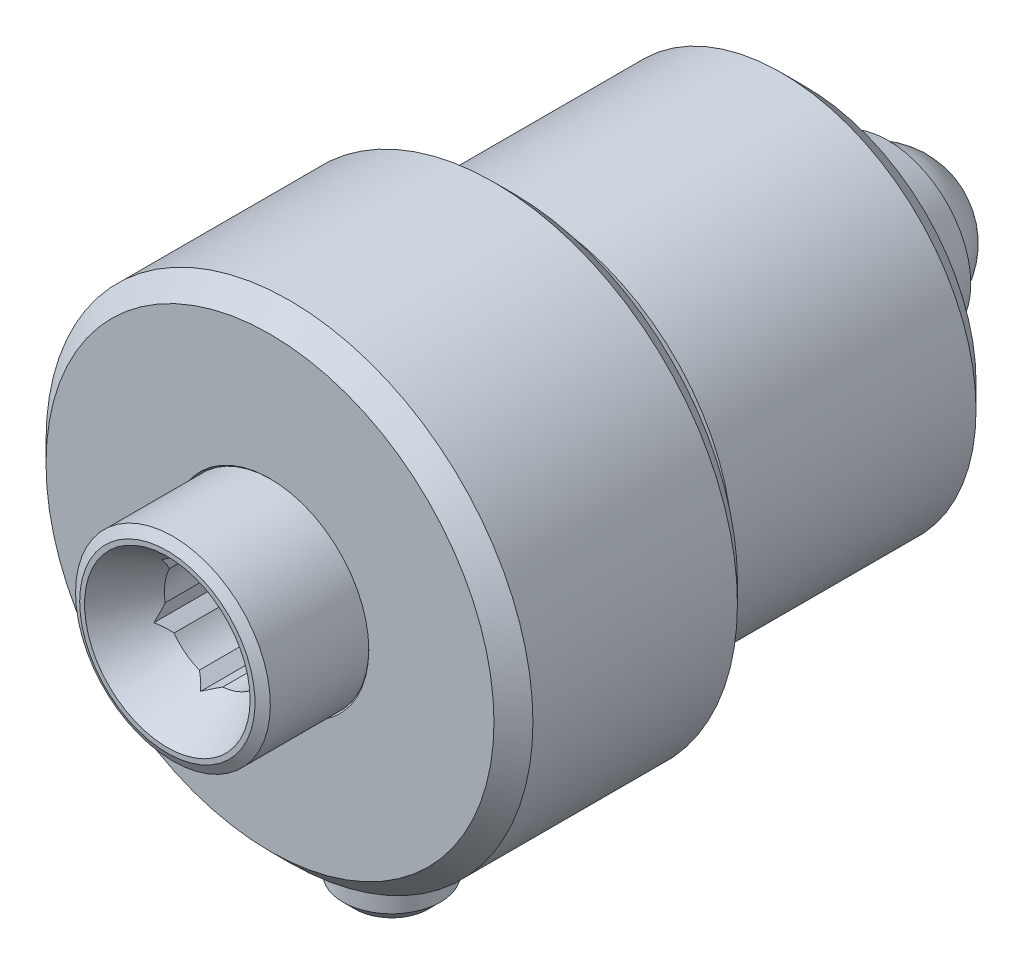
ISO-10303-21;
HEADER;
FILE_DESCRIPTION(('STEP AP214'),'2;1');
FILE_NAME('part.step','',(''),(''),'','','');
FILE_SCHEMA(('AUTOMOTIVE_DESIGN { 1 0 10303 214 1 1 1 1 }'));
ENDSEC;
DATA;
#1=APPLICATION_CONTEXT('core data for automotive mechanical design processes');
#2=APPLICATION_PROTOCOL_DEFINITION('international standard','automotive_design',2000,#1);
#3=PRODUCT_CONTEXT('',#1,'mechanical');
#4=PRODUCT('Part','Part','',(#3));
#5=PRODUCT_RELATED_PRODUCT_CATEGORY('part','',(#4));
#6=PRODUCT_DEFINITION_FORMATION('','',#4);
#7=PRODUCT_DEFINITION_CONTEXT('part definition',#1,'design');
#8=PRODUCT_DEFINITION('design','',#6,#7);
#9=PRODUCT_DEFINITION_SHAPE('','',#8);
#10=(LENGTH_UNIT() NAMED_UNIT(*) SI_UNIT(.MILLI.,.METRE.));
#11=(NAMED_UNIT(*) PLANE_ANGLE_UNIT() SI_UNIT($,.RADIAN.));
#12=(NAMED_UNIT(*) SI_UNIT($,.STERADIAN.) SOLID_ANGLE_UNIT());
#13=UNCERTAINTY_MEASURE_WITH_UNIT(LENGTH_MEASURE(1.E-05),#10,'distance_accuracy_value','');
#14=(GEOMETRIC_REPRESENTATION_CONTEXT(3) GLOBAL_UNCERTAINTY_ASSIGNED_CONTEXT((#13)) GLOBAL_UNIT_ASSIGNED_CONTEXT((#10,
#11,#12)) REPRESENTATION_CONTEXT('',''));
#15=CARTESIAN_POINT('',(0.,0.,0.));
#16=DIRECTION('',(0.,0.,1.));
#17=DIRECTION('',(1.,0.,0.));
#18=AXIS2_PLACEMENT_3D('',#15,#16,#17);
#19=CARTESIAN_POINT('',(0.,0.,-1.42346280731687));
#20=DIRECTION('',(0.165988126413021,0.521347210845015,0.837045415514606));
#21=DIRECTION('',(-0.37122944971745,-0.753342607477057,0.542829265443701));
#22=AXIS2_PLACEMENT_3D('',#19,#20,#21);
#23=SPHERICAL_SURFACE('',#22,1.5);
#24=CARTESIAN_POINT('',(-0.248982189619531,-0.782020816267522,-2.67903093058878));
#25=VERTEX_POINT('',#24);
#26=VERTEX_LOOP('',#25);
#27=FACE_BOUND('',#26,.T.);
#28=CARTESIAN_POINT('',(0.,1.47585065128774,-1.69153901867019));
#29=CARTESIAN_POINT('',(-0.0829018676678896,1.47584453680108,-1.69153901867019));
#30=CARTESIAN_POINT('',(-0.165897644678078,1.46883174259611,-1.69153901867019));
#31=CARTESIAN_POINT('',(-0.288543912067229,1.44796751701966,-1.69153901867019));
#32=CARTESIAN_POINT('',(-0.329152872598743,1.4392764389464,-1.69153901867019));
#33=CARTESIAN_POINT('',(-0.409534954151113,1.41849907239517,-1.69153901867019));
#34=CARTESIAN_POINT('',(-0.449307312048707,1.40640981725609,-1.69153901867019));
#35=CARTESIAN_POINT('',(-0.566773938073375,1.36520055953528,-1.69153901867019));
#36=CARTESIAN_POINT('',(-0.64278262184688,1.33111083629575,-1.69153901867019));
#37=CARTESIAN_POINT('',(-0.787990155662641,1.25063854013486,-1.69153901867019));
#38=CARTESIAN_POINT('',(-0.85718886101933,1.20425570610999,-1.69153901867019));
#39=CARTESIAN_POINT('',(-0.954378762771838,1.12651011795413,-1.69153901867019));
#40=CARTESIAN_POINT('',(-0.985692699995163,1.09921210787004,-1.69153901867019));
#41=CARTESIAN_POINT('',(-1.04588262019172,1.04210578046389,-1.69153901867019));
#42=CARTESIAN_POINT('',(-1.07476091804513,1.01229990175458,-1.69153901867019));
#43=CARTESIAN_POINT('',(-1.15748734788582,0.919361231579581,-1.69153901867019));
#44=CARTESIAN_POINT('',(-1.20745051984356,0.852688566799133,-1.69153901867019));
#45=CARTESIAN_POINT('',(-1.29544663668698,0.711934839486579,-1.69153901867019));
#46=CARTESIAN_POINT('',(-1.33347955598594,0.637853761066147,-1.69153901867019));
#47=CARTESIAN_POINT('',(-1.3965738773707,0.4843533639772,-1.69153901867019));
#48=CARTESIAN_POINT('',(-1.42163597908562,0.404934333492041,-1.69153901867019));
#49=CARTESIAN_POINT('',(-1.4580668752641,0.243025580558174,-1.69153901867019));
#50=CARTESIAN_POINT('',(-1.46943719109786,0.160536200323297,-1.69153901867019));
#51=CARTESIAN_POINT('',(-1.47817377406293,-0.00519728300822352,-1.69153901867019));
#52=CARTESIAN_POINT('',(-1.47553617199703,-0.0884415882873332,-1.69153901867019));
#53=CARTESIAN_POINT('',(-1.45547711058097,-0.260489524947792,-1.69153901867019));
#54=CARTESIAN_POINT('',(-1.43679200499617,-0.349148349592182,-1.69153901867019));
#55=CARTESIAN_POINT('',(-1.38356099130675,-0.521569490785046,-1.69153901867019));
#56=CARTESIAN_POINT('',(-1.34901506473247,-0.605331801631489,-1.69153901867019));
#57=CARTESIAN_POINT('',(-1.26859569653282,-0.758745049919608,-1.69153901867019));
#58=CARTESIAN_POINT('',(-1.22384759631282,-0.828988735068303,-1.69153901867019));
#59=CARTESIAN_POINT('',(-1.12320312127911,-0.960953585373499,-1.69153901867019));
#60=CARTESIAN_POINT('',(-1.06730985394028,-1.02267711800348,-1.69153901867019));
#61=CARTESIAN_POINT('',(-0.945949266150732,-1.13587061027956,-1.69153901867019));
#62=CARTESIAN_POINT('',(-0.88048085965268,-1.18733940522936,-1.69153901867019));
#63=CARTESIAN_POINT('',(-0.741828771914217,-1.27855841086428,-1.69153901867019));
#64=CARTESIAN_POINT('',(-0.668644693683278,-1.31830801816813,-1.69153901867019));
#65=CARTESIAN_POINT('',(-0.516643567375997,-1.38495525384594,-1.69153901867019));
#66=CARTESIAN_POINT('',(-0.437826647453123,-1.41185317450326,-1.69153901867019));
#67=CARTESIAN_POINT('',(-0.276796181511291,-1.45203488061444,-1.69153901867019));
#68=CARTESIAN_POINT('',(-0.194582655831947,-1.46531874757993,-1.69153901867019));
#69=CARTESIAN_POINT('',(-0.0290920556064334,-1.47789551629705,-1.69153901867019));
#70=CARTESIAN_POINT('',(0.0541850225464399,-1.47718837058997,-1.69153901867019));
#71=CARTESIAN_POINT('',(0.219438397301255,-1.46180308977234,-1.69153901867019));
#72=CARTESIAN_POINT('',(0.301414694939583,-1.44712496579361,-1.69153901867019));
#73=CARTESIAN_POINT('',(0.461739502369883,-1.40421441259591,-1.69153901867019));
#74=CARTESIAN_POINT('',(0.540088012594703,-1.37598198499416,-1.69153901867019));
#75=CARTESIAN_POINT('',(0.690933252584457,-1.30676422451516,-1.69153901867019));
#76=CARTESIAN_POINT('',(0.763429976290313,-1.26577887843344,-1.69153901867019));
#77=CARTESIAN_POINT('',(0.900513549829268,-1.17221876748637,-1.69153901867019));
#78=CARTESIAN_POINT('',(0.965100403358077,-1.11964400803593,-1.69153901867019));
#79=CARTESIAN_POINT('',(1.08453083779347,-1.00439750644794,-1.69153901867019));
#80=CARTESIAN_POINT('',(1.13937441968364,-0.941725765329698,-1.69153901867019));
#81=CARTESIAN_POINT('',(1.23776161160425,-0.808064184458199,-1.69153901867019));
#82=CARTESIAN_POINT('',(1.28130519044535,-0.737074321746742,-1.69153901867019));
#83=CARTESIAN_POINT('',(1.3558558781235,-0.588792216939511,-1.69153901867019));
#84=CARTESIAN_POINT('',(1.386863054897,-0.511500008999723,-1.69153901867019));
#85=CARTESIAN_POINT('',(1.43546077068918,-0.352808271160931,-1.69153901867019));
#86=CARTESIAN_POINT('',(1.45305151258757,-0.271408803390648,-1.69153901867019));
#87=CARTESIAN_POINT('',(1.47431796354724,-0.106808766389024,-1.69153901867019));
#88=CARTESIAN_POINT('',(1.47799317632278,-0.023608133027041,-1.69153901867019));
#89=CARTESIAN_POINT('',(1.47132343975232,0.142233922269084,-1.69153901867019));
#90=CARTESIAN_POINT('',(1.46097751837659,0.224875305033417,-1.69153901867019));
#91=CARTESIAN_POINT('',(1.42655748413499,0.387237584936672,-1.69153901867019));
#92=CARTESIAN_POINT('',(1.40248576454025,0.466958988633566,-1.69153901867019));
#93=CARTESIAN_POINT('',(1.34299438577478,0.616969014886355,-1.69153901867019));
#94=CARTESIAN_POINT('',(1.3082723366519,0.687535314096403,-1.69153901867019));
#95=CARTESIAN_POINT('',(1.22807379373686,0.822262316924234,-1.69153901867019));
#96=CARTESIAN_POINT('',(1.1825977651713,0.886423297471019,-1.69153901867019));
#97=CARTESIAN_POINT('',(1.0791037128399,1.01022310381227,-1.69153901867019));
#98=CARTESIAN_POINT('',(1.02051010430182,1.06938194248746,-1.69153901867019));
#99=CARTESIAN_POINT('',(0.894196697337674,1.17704598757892,-1.69153901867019));
#100=CARTESIAN_POINT('',(0.826472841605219,1.22554643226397,-1.69153901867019));
#101=CARTESIAN_POINT('',(0.683818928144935,1.31050549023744,-1.69153901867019));
#102=CARTESIAN_POINT('',(0.608885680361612,1.34695874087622,-1.69153901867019));
#103=CARTESIAN_POINT('',(0.45402989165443,1.40672081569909,-1.69153901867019));
#104=CARTESIAN_POINT('',(0.374114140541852,1.43004711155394,-1.69153901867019));
#105=CARTESIAN_POINT('',(0.244696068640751,1.45625581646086,-1.69153901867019));
#106=CARTESIAN_POINT('',(0.196053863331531,1.46359492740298,-1.69153901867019));
#107=CARTESIAN_POINT('',(0.0982854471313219,1.47339416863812,-1.69153901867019));
#108=CARTESIAN_POINT('',(0.0491592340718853,1.47585427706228,-1.69153901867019));
#109=CARTESIAN_POINT('',(0.,1.47585065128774,-1.69153901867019));
#110=B_SPLINE_CURVE_WITH_KNOTS('',3,(#28,#29,#30,#31,#32,#33,#34,#35,#36,#37,#38,#39,#40,#41,
#42,#43,#44,#45,#46,#47,#48,#49,#50,#51,#52,#53,#54,#55,#56,#57,#58,#59,#60,#61,#62,#63,#64,#65,
#66,#67,#68,#69,#70,#71,#72,#73,#74,#75,#76,#77,#78,#79,#80,#81,#82,#83,#84,#85,#86,#87,#88,#89,
#90,#91,#92,#93,#94,#95,#96,#97,#98,#99,#100,#101,#102,#103,#104,#105,#106,#107,#108,#109),
.UNSPECIFIED.,.T.,.F.,(4,2,2,2,2,2,2,2,2,2,2,2,2,2,2,2,2,2,2,2,2,2,2,2,2,2,2,2,2,2,2,2,2,2,2,2,
2,2,2,2,4),(0.,0.248496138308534,0.372962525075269,0.497537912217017,0.746193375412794,
0.994854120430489,1.11935055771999,1.24372730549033,1.49239158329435,1.74105639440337,
1.98970779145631,2.23833155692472,2.48702399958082,2.75730780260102,3.02759192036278,
3.27628464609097,3.52490812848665,3.77355983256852,4.02222433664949,4.27088318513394,
4.51954054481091,4.76819874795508,5.01685675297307,5.26551472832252,5.51417296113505,
5.7628310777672,6.01148916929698,6.26014794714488,6.50880537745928,6.75745904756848,
7.00612158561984,7.25480136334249,7.5034377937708,7.73838756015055,7.97332716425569,
8.22192984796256,8.47064337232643,8.71946745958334,8.96795957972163,9.11531241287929,
9.26266590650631),.UNSPECIFIED.);
#111=CARTESIAN_POINT('',(0.,1.47585065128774,-1.69153901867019));
#112=VERTEX_POINT('',#111);
#113=EDGE_CURVE('E305',#112,#112,#110,.T.);
#114=ORIENTED_EDGE('',*,*,#113,.F.);
#115=EDGE_LOOP('',(#114));
#116=FACE_BOUND('',#115,.T.);
#117=ADVANCED_FACE('F17',(#27,#116),#23,.T.);
#118=CARTESIAN_POINT('',(1.12080950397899,0.462370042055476,13.1084609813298));
#119=DIRECTION('',(0.609900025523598,0.792478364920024,0.));
#120=DIRECTION('',(-0.792478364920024,0.609900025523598,0.));
#121=AXIS2_PLACEMENT_3D('',#118,#119,#120);
#122=PLANE('',#121);
#123=DIRECTION('',(0.,0.,1.));
#124=VECTOR('',#123,1.);
#125=CARTESIAN_POINT('',(0.159980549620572,1.20183452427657,13.1084609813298));
#126=LINE('',#125,#124);
#127=CARTESIAN_POINT('',(0.159980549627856,1.20183452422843,12.2639746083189));
#128=VERTEX_POINT('',#127);
#129=CARTESIAN_POINT('',(0.159980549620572,1.20183452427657,8.10846098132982));
#130=VERTEX_POINT('',#129);
#131=EDGE_CURVE('E308',#128,#130,#126,.F.);
#132=ORIENTED_EDGE('',*,*,#131,.T.);
#133=DIRECTION('',(-0.792478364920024,0.609900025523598,0.));
#134=VECTOR('',#133,1.);
#135=CARTESIAN_POINT('',(0.380563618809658,1.03207137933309,8.10846098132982));
#136=LINE('',#135,#134);
#137=CARTESIAN_POINT('',(0.380563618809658,1.03207137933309,8.10846098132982));
#138=VERTEX_POINT('',#137);
#139=EDGE_CURVE('E919',#138,#130,#136,.T.);
#140=ORIENTED_EDGE('',*,*,#139,.F.);
#141=DIRECTION('',(0.,0.,1.));
#142=VECTOR('',#141,1.);
#143=CARTESIAN_POINT('',(0.380563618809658,1.03207137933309,10.1084609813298));
#144=LINE('',#143,#142);
#145=CARTESIAN_POINT('',(0.38056361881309,1.03207137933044,12.0692304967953));
#146=VERTEX_POINT('',#145);
#147=EDGE_CURVE('E349',#138,#146,#144,.T.);
#148=ORIENTED_EDGE('',*,*,#147,.T.);
#149=CARTESIAN_POINT('',(0.159980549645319,1.20183452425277,12.2639746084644));
#150=CARTESIAN_POINT('',(0.177001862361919,1.18873473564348,12.2453856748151));
#151=CARTESIAN_POINT('',(0.194311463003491,1.17541307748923,12.2271992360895));
#152=CARTESIAN_POINT('',(0.229536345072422,1.14830362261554,12.1919501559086));
#153=CARTESIAN_POINT('',(0.247449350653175,1.13451757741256,12.17488388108));
#154=CARTESIAN_POINT('',(0.284037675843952,1.10635880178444,12.1420522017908));
#155=CARTESIAN_POINT('',(0.302713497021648,1.09198568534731,12.1262876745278));
#156=CARTESIAN_POINT('',(0.34095992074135,1.06255081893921,12.0964053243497));
#157=CARTESIAN_POINT('',(0.360533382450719,1.04748686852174,12.0822933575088));
#158=CARTESIAN_POINT('',(0.380563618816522,1.0320713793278,12.0692304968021));
#159=B_SPLINE_CURVE_WITH_KNOTS('',3,(#149,#150,#151,#152,#153,#154,#155,#156,#157,#158),
.UNSPECIFIED.,.F.,.F.,(4,2,2,2,4),(0.,0.0852281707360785,0.170164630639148,0.255157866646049,
0.340443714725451),.UNSPECIFIED.);
#160=EDGE_CURVE('E340',#128,#146,#159,.T.);
#161=ORIENTED_EDGE('',*,*,#160,.F.);
#162=EDGE_LOOP('',(#132,#140,#148,#161));
#163=FACE_BOUND('',#162,.T.);
#164=ADVANCED_FACE('F328',(#163),#122,.F.);
#165=CARTESIAN_POINT('',(1.12080950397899,0.462370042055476,13.1084609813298));
#166=DIRECTION('',(0.609900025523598,0.792478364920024,0.));
#167=DIRECTION('',(-0.792478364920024,0.609900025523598,0.));
#168=AXIS2_PLACEMENT_3D('',#165,#166,#167);
#169=PLANE('',#168);
#170=DIRECTION('',(0.,0.,1.));
#171=VECTOR('',#170,1.);
#172=CARTESIAN_POINT('',(0.9002264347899,0.632133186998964,10.1084609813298));
#173=LINE('',#172,#171);
#174=CARTESIAN_POINT('',(0.900226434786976,0.632133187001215,12.0692304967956));
#175=VERTEX_POINT('',#174);
#176=CARTESIAN_POINT('',(0.9002264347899,0.632133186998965,8.10846098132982));
#177=VERTEX_POINT('',#176);
#178=EDGE_CURVE('E348',#175,#177,#173,.F.);
#179=ORIENTED_EDGE('',*,*,#178,.T.);
#180=DIRECTION('',(-0.792478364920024,0.609900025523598,0.));
#181=VECTOR('',#180,1.);
#182=CARTESIAN_POINT('',(1.12080950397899,0.462370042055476,8.10846098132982));
#183=LINE('',#182,#181);
#184=CARTESIAN_POINT('',(1.12080950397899,0.462370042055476,8.10846098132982));
#185=VERTEX_POINT('',#184);
#186=EDGE_CURVE('E747',#185,#177,#183,.T.);
#187=ORIENTED_EDGE('',*,*,#186,.F.);
#188=DIRECTION('',(0.,0.,1.));
#189=VECTOR('',#188,1.);
#190=CARTESIAN_POINT('',(1.12080950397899,0.462370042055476,13.1084609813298));
#191=LINE('',#190,#189);
#192=CARTESIAN_POINT('',(1.12080950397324,0.462370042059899,12.2639746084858));
#193=VERTEX_POINT('',#192);
#194=EDGE_CURVE('E758',#185,#193,#191,.T.);
#195=ORIENTED_EDGE('',*,*,#194,.T.);
#196=CARTESIAN_POINT('',(0.900226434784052,0.632133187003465,12.0692304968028));
#197=CARTESIAN_POINT('',(0.920256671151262,0.61671769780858,12.0822933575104));
#198=CARTESIAN_POINT('',(0.939830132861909,0.601653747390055,12.0964053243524));
#199=CARTESIAN_POINT('',(0.978076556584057,0.572218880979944,12.1262876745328));
#200=CARTESIAN_POINT('',(0.996752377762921,0.557845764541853,12.1420522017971));
#201=CARTESIAN_POINT('',(1.03334070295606,0.529686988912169,12.174883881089));
#202=CARTESIAN_POINT('',(1.05125370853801,0.515900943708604,12.1919501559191));
#203=CARTESIAN_POINT('',(1.08647859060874,0.488791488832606,12.2271992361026));
#204=CARTESIAN_POINT('',(1.10378819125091,0.47546983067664,12.2453856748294));
#205=CARTESIAN_POINT('',(1.12080950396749,0.462370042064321,12.2639746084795));
#206=B_SPLINE_CURVE_WITH_KNOTS('',3,(#196,#197,#198,#199,#200,#201,#202,#203,#204,#205),
.UNSPECIFIED.,.F.,.F.,(4,2,2,2,4),(0.,0.0852858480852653,0.170279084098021,0.255215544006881,
0.340443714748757),.UNSPECIFIED.);
#207=EDGE_CURVE('E369',#175,#193,#206,.T.);
#208=ORIENTED_EDGE('',*,*,#207,.F.);
#209=EDGE_LOOP('',(#179,#187,#195,#208));
#210=FACE_BOUND('',#209,.T.);
#211=ADVANCED_FACE('F335',(#210),#169,.F.);
#212=CARTESIAN_POINT('',(0.,0.,8.10846098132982));
#213=DIRECTION('',(0.,0.,1.));
#214=DIRECTION('',(0.,-1.,0.));
#215=AXIS2_PLACEMENT_3D('',#212,#213,#214);
#216=PLANE('',#215);
#217=DIRECTION('',(0.131949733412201,0.991256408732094,0.));
#218=VECTOR('',#217,1.);
#219=CARTESIAN_POINT('',(0.960828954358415,-0.739464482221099,8.10846098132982));
#220=LINE('',#219,#218);
#221=CARTESIAN_POINT('',(1.08408184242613,0.186457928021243,8.10846098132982));
#222=VERTEX_POINT('',#221);
#223=EDGE_CURVE('E757',#222,#185,#220,.T.);
#224=ORIENTED_EDGE('',*,*,#223,.T.);
#225=ORIENTED_EDGE('',*,*,#186,.T.);
#226=CARTESIAN_POINT('',(0.,0.,8.10846098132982));
#227=DIRECTION('',(0.,0.,1.));
#228=DIRECTION('',(1.,0.,0.));
#229=AXIS2_PLACEMENT_3D('',#226,#227,#228);
#230=CIRCLE('',#229,1.1);
#231=EDGE_CURVE('E755',#177,#222,#230,.F.);
#232=ORIENTED_EDGE('',*,*,#231,.T.);
#233=EDGE_LOOP('',(#224,#225,#232));
#234=FACE_BOUND('',#233,.T.);
#235=ADVANCED_FACE('F738',(#234),#216,.T.);
#236=CARTESIAN_POINT('',(0.960828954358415,-0.739464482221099,13.1084609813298));
#237=DIRECTION('',(0.991256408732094,-0.131949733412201,0.));
#238=DIRECTION('',(0.131949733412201,0.991256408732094,0.));
#239=AXIS2_PLACEMENT_3D('',#236,#237,#238);
#240=PLANE('',#239);
#241=ORIENTED_EDGE('',*,*,#194,.F.);
#242=ORIENTED_EDGE('',*,*,#223,.F.);
#243=DIRECTION('',(0.,0.,1.));
#244=VECTOR('',#243,1.);
#245=CARTESIAN_POINT('',(1.08408184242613,0.186457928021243,10.1084609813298));
#246=LINE('',#245,#244);
#247=CARTESIAN_POINT('',(1.08408184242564,0.186457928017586,12.0692304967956));
#248=VERTEX_POINT('',#247);
#249=EDGE_CURVE('E761',#222,#248,#246,.T.);
#250=ORIENTED_EDGE('',*,*,#249,.T.);
#251=CARTESIAN_POINT('',(1.12080950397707,0.462370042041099,12.2639746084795));
#252=CARTESIAN_POINT('',(1.11797541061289,0.441079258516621,12.2453856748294));
#253=CARTESIAN_POINT('',(1.11509331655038,0.419427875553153,12.2271992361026));
#254=CARTESIAN_POINT('',(1.10922828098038,0.375367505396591,12.1919501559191));
#255=CARTESIAN_POINT('',(1.10624571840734,0.35296136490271,12.174883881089));
#256=CARTESIAN_POINT('',(1.10015366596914,0.307195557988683,12.1420522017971));
#257=CARTESIAN_POINT('',(1.09704409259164,0.283835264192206,12.1262876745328));
#258=CARTESIAN_POINT('',(1.09067596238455,0.235995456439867,12.0964053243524));
#259=CARTESIAN_POINT('',(1.08741692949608,0.211512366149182,12.0822933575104));
#260=CARTESIAN_POINT('',(1.08408184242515,0.186457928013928,12.0692304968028));
#261=B_SPLINE_CURVE_WITH_KNOTS('',3,(#251,#252,#253,#254,#255,#256,#257,#258,#259,#260),
.UNSPECIFIED.,.F.,.F.,(4,2,2,2,4),(0.,0.0852281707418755,0.170164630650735,0.255157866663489,
0.340443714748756),.UNSPECIFIED.);
#262=EDGE_CURVE('E377',#193,#248,#261,.T.);
#263=ORIENTED_EDGE('',*,*,#262,.F.);
#264=EDGE_LOOP('',(#241,#242,#250,#263));
#265=FACE_BOUND('',#264,.T.);
#266=ADVANCED_FACE('F734',(#265),#240,.F.);
#267=CARTESIAN_POINT('',(0.960828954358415,-0.739464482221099,13.1084609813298));
#268=DIRECTION('',(0.991256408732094,-0.131949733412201,0.));
#269=DIRECTION('',(0.131949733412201,0.991256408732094,0.));
#270=AXIS2_PLACEMENT_3D('',#267,#268,#269);
#271=PLANE('',#270);
#272=DIRECTION('',(0.,0.,1.));
#273=VECTOR('',#272,1.);
#274=CARTESIAN_POINT('',(0.997556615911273,-0.463552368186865,10.1084609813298));
#275=LINE('',#274,#273);
#276=CARTESIAN_POINT('',(0.99755661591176,-0.463552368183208,12.0692304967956));
#277=VERTEX_POINT('',#276);
#278=CARTESIAN_POINT('',(0.997556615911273,-0.463552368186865,8.10846098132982));
#279=VERTEX_POINT('',#278);
#280=EDGE_CURVE('E767',#277,#279,#275,.F.);
#281=ORIENTED_EDGE('',*,*,#280,.T.);
#282=DIRECTION('',(0.1319497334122,0.991256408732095,0.));
#283=VECTOR('',#282,1.);
#284=CARTESIAN_POINT('',(0.960828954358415,-0.739464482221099,8.10846098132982));
#285=LINE('',#284,#283);
#286=CARTESIAN_POINT('',(0.960828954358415,-0.739464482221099,8.10846098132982));
#287=VERTEX_POINT('',#286);
#288=EDGE_CURVE('E768',#287,#279,#285,.T.);
#289=ORIENTED_EDGE('',*,*,#288,.F.);
#290=DIRECTION('',(0.,0.,1.));
#291=VECTOR('',#290,1.);
#292=CARTESIAN_POINT('',(0.960828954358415,-0.739464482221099,13.1084609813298));
#293=LINE('',#292,#291);
#294=CARTESIAN_POINT('',(0.960828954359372,-0.739464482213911,12.2639746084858));
#295=VERTEX_POINT('',#294);
#296=EDGE_CURVE('E771',#287,#295,#293,.T.);
#297=ORIENTED_EDGE('',*,*,#296,.T.);
#298=CARTESIAN_POINT('',(0.997556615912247,-0.46355236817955,12.0692304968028));
#299=CARTESIAN_POINT('',(0.994221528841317,-0.488606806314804,12.0822933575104));
#300=CARTESIAN_POINT('',(0.990962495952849,-0.513089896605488,12.0964053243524));
#301=CARTESIAN_POINT('',(0.984594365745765,-0.560929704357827,12.1262876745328));
#302=CARTESIAN_POINT('',(0.981484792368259,-0.584289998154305,12.1420522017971));
#303=CARTESIAN_POINT('',(0.975392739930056,-0.630055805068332,12.174883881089));
#304=CARTESIAN_POINT('',(0.972410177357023,-0.652461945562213,12.1919501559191));
#305=CARTESIAN_POINT('',(0.966545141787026,-0.696522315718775,12.2271992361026));
#306=CARTESIAN_POINT('',(0.963663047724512,-0.718173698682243,12.2453856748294));
#307=CARTESIAN_POINT('',(0.960828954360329,-0.739464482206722,12.2639746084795));
#308=B_SPLINE_CURVE_WITH_KNOTS('',3,(#298,#299,#300,#301,#302,#303,#304,#305,#306,#307),
.UNSPECIFIED.,.F.,.F.,(4,2,2,2,4),(0.,0.0852858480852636,0.170279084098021,0.255215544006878,
0.340443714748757),.UNSPECIFIED.);
#309=EDGE_CURVE('E386',#277,#295,#308,.T.);
#310=ORIENTED_EDGE('',*,*,#309,.F.);
#311=EDGE_LOOP('',(#281,#289,#297,#310));
#312=FACE_BOUND('',#311,.T.);
#313=ADVANCED_FACE('F729',(#312),#271,.F.);
#314=CARTESIAN_POINT('',(0.,0.,8.10846098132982));
#315=DIRECTION('',(0.,0.,1.));
#316=DIRECTION('',(0.,-1.,0.));
#317=AXIS2_PLACEMENT_3D('',#314,#315,#316);
#318=PLANE('',#317);
#319=DIRECTION('',(0.924428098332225,0.381356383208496,0.));
#320=VECTOR('',#319,1.);
#321=CARTESIAN_POINT('',(-0.15998054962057,-1.20183452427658,8.10846098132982));
#322=LINE('',#321,#320);
#323=CARTESIAN_POINT('',(0.70351822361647,-0.845613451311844,8.10846098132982));
#324=VERTEX_POINT('',#323);
#325=EDGE_CURVE('E775',#324,#287,#322,.T.);
#326=ORIENTED_EDGE('',*,*,#325,.T.);
#327=ORIENTED_EDGE('',*,*,#288,.T.);
#328=CARTESIAN_POINT('',(0.,0.,8.10846098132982));
#329=DIRECTION('',(0.,0.,1.));
#330=DIRECTION('',(1.,0.,0.));
#331=AXIS2_PLACEMENT_3D('',#328,#329,#330);
#332=CIRCLE('',#331,1.1);
#333=EDGE_CURVE('E779',#279,#324,#332,.F.);
#334=ORIENTED_EDGE('',*,*,#333,.T.);
#335=EDGE_LOOP('',(#326,#327,#334));
#336=FACE_BOUND('',#335,.T.);
#337=ADVANCED_FACE('F725',(#336),#318,.T.);
#338=CARTESIAN_POINT('',(-0.15998054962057,-1.20183452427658,13.1084609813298));
#339=DIRECTION('',(0.381356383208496,-0.924428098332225,0.));
#340=DIRECTION('',(0.924428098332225,0.381356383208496,0.));
#341=AXIS2_PLACEMENT_3D('',#338,#339,#340);
#342=PLANE('',#341);
#343=ORIENTED_EDGE('',*,*,#296,.F.);
#344=ORIENTED_EDGE('',*,*,#325,.F.);
#345=DIRECTION('',(0.,0.,1.));
#346=VECTOR('',#345,1.);
#347=CARTESIAN_POINT('',(0.70351822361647,-0.845613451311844,10.1084609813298));
#348=LINE('',#347,#346);
#349=CARTESIAN_POINT('',(0.703518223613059,-0.845613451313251,12.0692304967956));
#350=VERTEX_POINT('',#349);
#351=EDGE_CURVE('E781',#324,#350,#348,.T.);
#352=ORIENTED_EDGE('',*,*,#351,.T.);
#353=CARTESIAN_POINT('',(0.960828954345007,-0.73946448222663,12.2639746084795));
#354=CARTESIAN_POINT('',(0.940973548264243,-0.74765547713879,12.2453856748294));
#355=CARTESIAN_POINT('',(0.920781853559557,-0.755985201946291,12.2271992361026));
#356=CARTESIAN_POINT('',(0.87969193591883,-0.772936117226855,12.1919501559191));
#357=CARTESIAN_POINT('',(0.858796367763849,-0.781556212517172,12.174883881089));
#358=CARTESIAN_POINT('',(0.816115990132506,-0.799163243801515,12.1420522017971));
#359=CARTESIAN_POINT('',(0.794330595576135,-0.808150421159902,12.1262876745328));
#360=CARTESIAN_POINT('',(0.749716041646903,-0.82655536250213,12.0964053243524));
#361=CARTESIAN_POINT('',(0.726883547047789,-0.83597450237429,12.0822933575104));
#362=CARTESIAN_POINT('',(0.703518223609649,-0.845613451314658,12.0692304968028));
#363=B_SPLINE_CURVE_WITH_KNOTS('',3,(#353,#354,#355,#356,#357,#358,#359,#360,#361,#362),
.UNSPECIFIED.,.F.,.F.,(4,2,2,2,4),(0.,0.0852281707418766,0.170164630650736,0.255157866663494,
0.340443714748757),.UNSPECIFIED.);
#364=EDGE_CURVE('E395',#295,#350,#363,.T.);
#365=ORIENTED_EDGE('',*,*,#364,.F.);
#366=EDGE_LOOP('',(#343,#344,#352,#365));
#367=FACE_BOUND('',#366,.T.);
#368=ADVANCED_FACE('F721',(#367),#342,.F.);
#369=CARTESIAN_POINT('',(-0.991256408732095,0.131949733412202,-1.69153901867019));
#370=DIRECTION('',(0.,0.,-1.));
#371=DIRECTION('',(-1.,0.,0.));
#372=AXIS2_PLACEMENT_3D('',#369,#370,#371);
#373=PLANE('',#372);
#374=ORIENTED_EDGE('',*,*,#113,.T.);
#375=EDGE_LOOP('',(#374));
#376=FACE_BOUND('',#375,.T.);
#377=CARTESIAN_POINT('',(0.,0.,-1.69153901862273));
#378=DIRECTION('',(0.,0.,1.));
#379=DIRECTION('',(1.,0.,0.));
#380=AXIS2_PLACEMENT_3D('',#377,#378,#379);
#381=CIRCLE('',#380,1.69989690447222);
#382=CARTESIAN_POINT('',(1.69989690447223,0.,-1.69153901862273));
#383=VERTEX_POINT('',#382);
#384=EDGE_CURVE('E784',#383,#383,#381,.T.);
#385=ORIENTED_EDGE('',*,*,#384,.F.);
#386=EDGE_LOOP('',(#385));
#387=FACE_BOUND('',#386,.T.);
#388=ADVANCED_FACE('F716',(#376,#387),#373,.T.);
#389=CARTESIAN_POINT('',(0.,0.,7.10846098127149));
#390=DIRECTION('',(0.,0.,1.));
#391=DIRECTION('',(1.,0.,0.));
#392=AXIS2_PLACEMENT_3D('',#389,#390,#391);
#393=CONICAL_SURFACE('',#392,1.09999999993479,1.04719755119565);
#394=CARTESIAN_POINT('',(0.,0.,6.47337568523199));
#395=VERTEX_POINT('',#394);
#396=VERTEX_LOOP('',#395);
#397=FACE_BOUND('',#396,.T.);
#398=CARTESIAN_POINT('',(0.,0.,7.10846098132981));
#399=DIRECTION('',(0.,0.,1.));
#400=DIRECTION('',(1.,0.,0.));
#401=AXIS2_PLACEMENT_3D('',#398,#399,#400);
#402=CIRCLE('',#401,1.1);
#403=CARTESIAN_POINT('',(1.1,0.,7.10846098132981));
#404=VERTEX_POINT('',#403);
#405=EDGE_CURVE('E788',#404,#404,#402,.T.);
#406=ORIENTED_EDGE('',*,*,#405,.T.);
#407=EDGE_LOOP('',(#406));
#408=FACE_BOUND('',#407,.T.);
#409=ADVANCED_FACE('F712',(#397,#408),#393,.F.);
#410=CARTESIAN_POINT('',(-1.12080950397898,-0.462370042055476,13.1084609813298));
#411=DIRECTION('',(-0.609900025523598,-0.792478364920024,0.));
#412=DIRECTION('',(0.792478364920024,-0.609900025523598,0.));
#413=AXIS2_PLACEMENT_3D('',#410,#411,#412);
#414=PLANE('',#413);
#415=DIRECTION('',(0.,0.,1.));
#416=VECTOR('',#415,1.);
#417=CARTESIAN_POINT('',(-0.900226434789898,-0.632133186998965,10.1084609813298));
#418=LINE('',#417,#416);
#419=CARTESIAN_POINT('',(-0.900226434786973,-0.632133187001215,12.0692304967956));
#420=VERTEX_POINT('',#419);
#421=CARTESIAN_POINT('',(-0.900226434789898,-0.632133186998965,8.10846098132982));
#422=VERTEX_POINT('',#421);
#423=EDGE_CURVE('E792',#420,#422,#418,.F.);
#424=ORIENTED_EDGE('',*,*,#423,.T.);
#425=DIRECTION('',(0.792478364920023,-0.609900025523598,0.));
#426=VECTOR('',#425,1.);
#427=CARTESIAN_POINT('',(-1.12080950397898,-0.462370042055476,8.10846098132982));
#428=LINE('',#427,#426);
#429=CARTESIAN_POINT('',(-1.12080950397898,-0.462370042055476,8.10846098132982));
#430=VERTEX_POINT('',#429);
#431=EDGE_CURVE('E796',#430,#422,#428,.T.);
#432=ORIENTED_EDGE('',*,*,#431,.F.);
#433=DIRECTION('',(0.,0.,1.));
#434=VECTOR('',#433,1.);
#435=CARTESIAN_POINT('',(-1.12080950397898,-0.462370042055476,13.1084609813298));
#436=LINE('',#435,#434);
#437=CARTESIAN_POINT('',(-1.12080950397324,-0.462370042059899,12.2639746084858));
#438=VERTEX_POINT('',#437);
#439=EDGE_CURVE('E798',#430,#438,#436,.T.);
#440=ORIENTED_EDGE('',*,*,#439,.T.);
#441=CARTESIAN_POINT('',(-0.900226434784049,-0.632133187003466,12.0692304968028));
#442=CARTESIAN_POINT('',(-0.920256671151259,-0.616717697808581,12.0822933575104));
#443=CARTESIAN_POINT('',(-0.939830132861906,-0.601653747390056,12.0964053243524));
#444=CARTESIAN_POINT('',(-0.978076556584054,-0.572218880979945,12.1262876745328));
#445=CARTESIAN_POINT('',(-0.996752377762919,-0.557845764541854,12.1420522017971));
#446=CARTESIAN_POINT('',(-1.03334070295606,-0.529686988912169,12.174883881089));
#447=CARTESIAN_POINT('',(-1.05125370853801,-0.515900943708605,12.1919501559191));
#448=CARTESIAN_POINT('',(-1.08647859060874,-0.488791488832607,12.2271992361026));
#449=CARTESIAN_POINT('',(-1.10378819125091,-0.475469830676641,12.2453856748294));
#450=CARTESIAN_POINT('',(-1.12080950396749,-0.462370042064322,12.2639746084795));
#451=B_SPLINE_CURVE_WITH_KNOTS('',3,(#441,#442,#443,#444,#445,#446,#447,#448,#449,#450),
.UNSPECIFIED.,.F.,.F.,(4,2,2,2,4),(0.,0.0852858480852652,0.170279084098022,0.255215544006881,
0.340443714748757),.UNSPECIFIED.);
#452=EDGE_CURVE('E404',#420,#438,#451,.T.);
#453=ORIENTED_EDGE('',*,*,#452,.F.);
#454=EDGE_LOOP('',(#424,#432,#440,#453));
#455=FACE_BOUND('',#454,.T.);
#456=ADVANCED_FACE('F707',(#455),#414,.F.);
#457=CARTESIAN_POINT('',(0.,0.,8.10846098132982));
#458=DIRECTION('',(0.,0.,1.));
#459=DIRECTION('',(0.,-1.,0.));
#460=AXIS2_PLACEMENT_3D('',#457,#458,#459);
#461=PLANE('',#460);
#462=DIRECTION('',(-0.131949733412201,-0.991256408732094,0.));
#463=VECTOR('',#462,1.);
#464=CARTESIAN_POINT('',(-0.960828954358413,0.739464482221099,8.10846098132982));
#465=LINE('',#464,#463);
#466=CARTESIAN_POINT('',(-1.08408184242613,-0.186457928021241,8.10846098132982));
#467=VERTEX_POINT('',#466);
#468=EDGE_CURVE('E802',#467,#430,#465,.T.);
#469=ORIENTED_EDGE('',*,*,#468,.T.);
#470=ORIENTED_EDGE('',*,*,#431,.T.);
#471=CARTESIAN_POINT('',(0.,0.,8.10846098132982));
#472=DIRECTION('',(0.,0.,1.));
#473=DIRECTION('',(1.,0.,0.));
#474=AXIS2_PLACEMENT_3D('',#471,#472,#473);
#475=CIRCLE('',#474,1.1);
#476=EDGE_CURVE('E807',#422,#467,#475,.F.);
#477=ORIENTED_EDGE('',*,*,#476,.T.);
#478=EDGE_LOOP('',(#469,#470,#477));
#479=FACE_BOUND('',#478,.T.);
#480=ADVANCED_FACE('F703',(#479),#461,.T.);
#481=CARTESIAN_POINT('',(-0.960828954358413,0.739464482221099,13.1084609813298));
#482=DIRECTION('',(-0.991256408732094,0.131949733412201,0.));
#483=DIRECTION('',(-0.131949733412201,-0.991256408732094,0.));
#484=AXIS2_PLACEMENT_3D('',#481,#482,#483);
#485=PLANE('',#484);
#486=ORIENTED_EDGE('',*,*,#439,.F.);
#487=ORIENTED_EDGE('',*,*,#468,.F.);
#488=DIRECTION('',(0.,0.,1.));
#489=VECTOR('',#488,1.);
#490=CARTESIAN_POINT('',(-1.08408184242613,-0.186457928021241,10.1084609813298));
#491=LINE('',#490,#489);
#492=CARTESIAN_POINT('',(-1.08408184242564,-0.186457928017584,12.0692304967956));
#493=VERTEX_POINT('',#492);
#494=EDGE_CURVE('E809',#467,#493,#491,.T.);
#495=ORIENTED_EDGE('',*,*,#494,.T.);
#496=CARTESIAN_POINT('',(-1.12080950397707,-0.462370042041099,12.2639746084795));
#497=CARTESIAN_POINT('',(-1.11797541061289,-0.44107925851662,12.2453856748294));
#498=CARTESIAN_POINT('',(-1.11509331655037,-0.419427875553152,12.2271992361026));
#499=CARTESIAN_POINT('',(-1.10922828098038,-0.375367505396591,12.1919501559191));
#500=CARTESIAN_POINT('',(-1.10624571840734,-0.35296136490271,12.174883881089));
#501=CARTESIAN_POINT('',(-1.10015366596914,-0.307195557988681,12.1420522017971));
#502=CARTESIAN_POINT('',(-1.09704409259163,-0.283835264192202,12.1262876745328));
#503=CARTESIAN_POINT('',(-1.09067596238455,-0.235995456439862,12.0964053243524));
#504=CARTESIAN_POINT('',(-1.08741692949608,-0.211512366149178,12.0822933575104));
#505=CARTESIAN_POINT('',(-1.08408184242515,-0.186457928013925,12.0692304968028));
#506=B_SPLINE_CURVE_WITH_KNOTS('',3,(#496,#497,#498,#499,#500,#501,#502,#503,#504,#505),
.UNSPECIFIED.,.F.,.F.,(4,2,2,2,4),(0.,0.0852281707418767,0.170164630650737,0.255157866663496,
0.340443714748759),.UNSPECIFIED.);
#507=EDGE_CURVE('E413',#438,#493,#506,.T.);
#508=ORIENTED_EDGE('',*,*,#507,.F.);
#509=EDGE_LOOP('',(#486,#487,#495,#508));
#510=FACE_BOUND('',#509,.T.);
#511=ADVANCED_FACE('F699',(#510),#485,.F.);
#512=CARTESIAN_POINT('',(-0.960828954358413,0.739464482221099,13.1084609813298));
#513=DIRECTION('',(-0.991256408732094,0.131949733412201,0.));
#514=DIRECTION('',(-0.131949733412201,-0.991256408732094,0.));
#515=AXIS2_PLACEMENT_3D('',#512,#513,#514);
#516=PLANE('',#515);
#517=DIRECTION('',(0.,0.,1.));
#518=VECTOR('',#517,1.);
#519=CARTESIAN_POINT('',(-0.997556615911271,0.463552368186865,10.1084609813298));
#520=LINE('',#519,#518);
#521=CARTESIAN_POINT('',(-0.997556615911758,0.463552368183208,12.0692304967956));
#522=VERTEX_POINT('',#521);
#523=CARTESIAN_POINT('',(-0.997556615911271,0.463552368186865,8.10846098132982));
#524=VERTEX_POINT('',#523);
#525=EDGE_CURVE('E812',#522,#524,#520,.F.);
#526=ORIENTED_EDGE('',*,*,#525,.T.);
#527=DIRECTION('',(-0.131949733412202,-0.991256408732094,0.));
#528=VECTOR('',#527,1.);
#529=CARTESIAN_POINT('',(-0.960828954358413,0.739464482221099,8.10846098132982));
#530=LINE('',#529,#528);
#531=CARTESIAN_POINT('',(-0.960828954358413,0.739464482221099,8.10846098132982));
#532=VERTEX_POINT('',#531);
#533=EDGE_CURVE('E815',#532,#524,#530,.T.);
#534=ORIENTED_EDGE('',*,*,#533,.F.);
#535=DIRECTION('',(0.,0.,1.));
#536=VECTOR('',#535,1.);
#537=CARTESIAN_POINT('',(-0.960828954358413,0.739464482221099,13.1084609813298));
#538=LINE('',#537,#536);
#539=CARTESIAN_POINT('',(-0.96082895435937,0.73946448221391,12.2639746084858));
#540=VERTEX_POINT('',#539);
#541=EDGE_CURVE('E818',#532,#540,#538,.T.);
#542=ORIENTED_EDGE('',*,*,#541,.T.);
#543=CARTESIAN_POINT('',(-0.997556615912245,0.46355236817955,12.0692304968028));
#544=CARTESIAN_POINT('',(-0.994221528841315,0.488606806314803,12.0822933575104));
#545=CARTESIAN_POINT('',(-0.990962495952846,0.513089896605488,12.0964053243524));
#546=CARTESIAN_POINT('',(-0.984594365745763,0.560929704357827,12.1262876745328));
#547=CARTESIAN_POINT('',(-0.981484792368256,0.584289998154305,12.1420522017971));
#548=CARTESIAN_POINT('',(-0.975392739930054,0.630055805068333,12.174883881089));
#549=CARTESIAN_POINT('',(-0.97241017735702,0.652461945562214,12.1919501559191));
#550=CARTESIAN_POINT('',(-0.966545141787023,0.696522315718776,12.2271992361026));
#551=CARTESIAN_POINT('',(-0.96366304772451,0.718173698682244,12.2453856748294));
#552=CARTESIAN_POINT('',(-0.960828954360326,0.739464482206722,12.2639746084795));
#553=B_SPLINE_CURVE_WITH_KNOTS('',3,(#543,#544,#545,#546,#547,#548,#549,#550,#551,#552),
.UNSPECIFIED.,.F.,.F.,(4,2,2,2,4),(0.,0.0852858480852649,0.170279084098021,0.255215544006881,
0.340443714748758),.UNSPECIFIED.);
#554=EDGE_CURVE('E422',#522,#540,#553,.T.);
#555=ORIENTED_EDGE('',*,*,#554,.F.);
#556=EDGE_LOOP('',(#526,#534,#542,#555));
#557=FACE_BOUND('',#556,.T.);
#558=ADVANCED_FACE('F694',(#557),#516,.F.);
#559=CARTESIAN_POINT('',(0.,0.,8.10846098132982));
#560=DIRECTION('',(0.,0.,1.));
#561=DIRECTION('',(0.,-1.,0.));
#562=AXIS2_PLACEMENT_3D('',#559,#560,#561);
#563=PLANE('',#562);
#564=DIRECTION('',(-0.924428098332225,-0.381356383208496,0.));
#565=VECTOR('',#564,1.);
#566=CARTESIAN_POINT('',(0.159980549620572,1.20183452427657,8.10846098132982));
#567=LINE('',#566,#565);
#568=CARTESIAN_POINT('',(-0.703518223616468,0.845613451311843,8.10846098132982));
#569=VERTEX_POINT('',#568);
#570=EDGE_CURVE('E822',#569,#532,#567,.T.);
#571=ORIENTED_EDGE('',*,*,#570,.T.);
#572=ORIENTED_EDGE('',*,*,#533,.T.);
#573=CARTESIAN_POINT('',(0.,0.,8.10846098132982));
#574=DIRECTION('',(0.,0.,1.));
#575=DIRECTION('',(1.,0.,0.));
#576=AXIS2_PLACEMENT_3D('',#573,#574,#575);
#577=CIRCLE('',#576,1.1);
#578=EDGE_CURVE('E826',#524,#569,#577,.F.);
#579=ORIENTED_EDGE('',*,*,#578,.T.);
#580=EDGE_LOOP('',(#571,#572,#579));
#581=FACE_BOUND('',#580,.T.);
#582=ADVANCED_FACE('F690',(#581),#563,.T.);
#583=CARTESIAN_POINT('',(0.159980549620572,1.20183452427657,13.1084609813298));
#584=DIRECTION('',(-0.381356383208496,0.924428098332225,0.));
#585=DIRECTION('',(-0.924428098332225,-0.381356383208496,0.));
#586=AXIS2_PLACEMENT_3D('',#583,#584,#585);
#587=PLANE('',#586);
#588=ORIENTED_EDGE('',*,*,#541,.F.);
#589=ORIENTED_EDGE('',*,*,#570,.F.);
#590=DIRECTION('',(0.,0.,1.));
#591=VECTOR('',#590,1.);
#592=CARTESIAN_POINT('',(-0.703518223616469,0.845613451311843,10.1084609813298));
#593=LINE('',#592,#591);
#594=CARTESIAN_POINT('',(-0.703518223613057,0.84561345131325,12.0692304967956));
#595=VERTEX_POINT('',#594);
#596=EDGE_CURVE('E828',#569,#595,#593,.T.);
#597=ORIENTED_EDGE('',*,*,#596,.T.);
#598=CARTESIAN_POINT('',(-0.960828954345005,0.73946448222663,12.2639746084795));
#599=CARTESIAN_POINT('',(-0.94097354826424,0.74765547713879,12.2453856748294));
#600=CARTESIAN_POINT('',(-0.920781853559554,0.755985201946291,12.2271992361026));
#601=CARTESIAN_POINT('',(-0.879691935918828,0.772936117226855,12.1919501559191));
#602=CARTESIAN_POINT('',(-0.858796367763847,0.781556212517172,12.174883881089));
#603=CARTESIAN_POINT('',(-0.816115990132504,0.799163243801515,12.1420522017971));
#604=CARTESIAN_POINT('',(-0.794330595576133,0.808150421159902,12.1262876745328));
#605=CARTESIAN_POINT('',(-0.749716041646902,0.82655536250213,12.0964053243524));
#606=CARTESIAN_POINT('',(-0.726883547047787,0.83597450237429,12.0822933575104));
#607=CARTESIAN_POINT('',(-0.703518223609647,0.845613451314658,12.0692304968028));
#608=B_SPLINE_CURVE_WITH_KNOTS('',3,(#598,#599,#600,#601,#602,#603,#604,#605,#606,#607),
.UNSPECIFIED.,.F.,.F.,(4,2,2,2,4),(0.,0.0852281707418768,0.170164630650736,0.255157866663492,
0.340443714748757),.UNSPECIFIED.);
#609=EDGE_CURVE('E431',#540,#595,#608,.T.);
#610=ORIENTED_EDGE('',*,*,#609,.F.);
#611=EDGE_LOOP('',(#588,#589,#597,#610));
#612=FACE_BOUND('',#611,.T.);
#613=ADVANCED_FACE('F686',(#612),#587,.F.);
#614=CARTESIAN_POINT('',(0.159980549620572,1.20183452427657,13.1084609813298));
#615=DIRECTION('',(-0.381356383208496,0.924428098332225,0.));
#616=DIRECTION('',(-0.924428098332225,-0.381356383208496,0.));
#617=AXIS2_PLACEMENT_3D('',#614,#615,#616);
#618=PLANE('',#617);
#619=DIRECTION('',(0.,0.,1.));
#620=VECTOR('',#619,1.);
#621=CARTESIAN_POINT('',(-0.0973301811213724,1.09568555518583,10.1084609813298));
#622=LINE('',#621,#620);
#623=CARTESIAN_POINT('',(-0.0973301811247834,1.09568555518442,12.0692304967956));
#624=VERTEX_POINT('',#623);
#625=CARTESIAN_POINT('',(-0.097330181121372,1.09568555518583,8.10846098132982));
#626=VERTEX_POINT('',#625);
#627=EDGE_CURVE('E831',#624,#626,#622,.F.);
#628=ORIENTED_EDGE('',*,*,#627,.T.);
#629=DIRECTION('',(-0.924428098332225,-0.381356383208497,0.));
#630=VECTOR('',#629,1.);
#631=CARTESIAN_POINT('',(0.159980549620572,1.20183452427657,8.10846098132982));
#632=LINE('',#631,#630);
#633=EDGE_CURVE('E834',#130,#626,#632,.T.);
#634=ORIENTED_EDGE('',*,*,#633,.F.);
#635=ORIENTED_EDGE('',*,*,#131,.F.);
#636=CARTESIAN_POINT('',(-0.0973301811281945,1.09568555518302,12.0692304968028));
#637=CARTESIAN_POINT('',(-0.073964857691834,1.10532450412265,12.0822933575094));
#638=CARTESIAN_POINT('',(-0.0511323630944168,1.11474364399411,12.0964053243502));
#639=CARTESIAN_POINT('',(-0.00651780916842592,1.133148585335,12.1262876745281));
#640=CARTESIAN_POINT('',(0.0152675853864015,1.14213576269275,12.142052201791));
#641=CARTESIAN_POINT('',(0.0579479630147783,1.15974279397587,12.1748838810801));
#642=CARTESIAN_POINT('',(0.078843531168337,1.1683628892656,12.1919501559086));
#643=CARTESIAN_POINT('',(0.1199334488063,1.18531380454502,12.227199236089));
#644=CARTESIAN_POINT('',(0.140125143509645,1.19364352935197,12.2453856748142));
#645=CARTESIAN_POINT('',(0.159980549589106,1.20183452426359,12.2639746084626));
#646=B_SPLINE_CURVE_WITH_KNOTS('',3,(#636,#637,#638,#639,#640,#641,#642,#643,#644,#645),
.UNSPECIFIED.,.F.,.F.,(4,2,2,2,4),(0.,0.0852858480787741,0.170279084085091,0.255215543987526,
0.340443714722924),.UNSPECIFIED.);
#647=EDGE_CURVE('E439',#624,#128,#646,.T.);
#648=ORIENTED_EDGE('',*,*,#647,.F.);
#649=EDGE_LOOP('',(#628,#634,#635,#648));
#650=FACE_BOUND('',#649,.T.);
#651=ADVANCED_FACE('F681',(#650),#618,.F.);
#652=CARTESIAN_POINT('',(0.,0.,8.10846098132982));
#653=DIRECTION('',(0.,0.,1.));
#654=DIRECTION('',(0.,-1.,0.));
#655=AXIS2_PLACEMENT_3D('',#652,#653,#654);
#656=PLANE('',#655);
#657=ORIENTED_EDGE('',*,*,#633,.T.);
#658=CARTESIAN_POINT('',(0.,0.,8.10846098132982));
#659=DIRECTION('',(0.,0.,1.));
#660=DIRECTION('',(1.,0.,0.));
#661=AXIS2_PLACEMENT_3D('',#658,#659,#660);
#662=CIRCLE('',#661,1.1);
#663=EDGE_CURVE('E842',#626,#138,#662,.F.);
#664=ORIENTED_EDGE('',*,*,#663,.T.);
#665=ORIENTED_EDGE('',*,*,#139,.T.);
#666=EDGE_LOOP('',(#657,#664,#665));
#667=FACE_BOUND('',#666,.T.);
#668=ADVANCED_FACE('F676',(#667),#656,.T.);
#669=CARTESIAN_POINT('',(0.,0.,-0.571539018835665));
#670=DIRECTION('',(0.,0.,1.));
#671=DIRECTION('',(1.,0.,0.));
#672=AXIS2_PLACEMENT_3D('',#669,#670,#671);
#673=CONICAL_SURFACE('',#672,1.99999999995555,0.261799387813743);
#674=CARTESIAN_POINT('',(0.,0.,-0.571539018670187));
#675=DIRECTION('',(0.,0.,1.));
#676=DIRECTION('',(1.,0.,0.));
#677=AXIS2_PLACEMENT_3D('',#674,#675,#676);
#678=CIRCLE('',#677,2.);
#679=CARTESIAN_POINT('',(2.,0.,-0.571539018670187));
#680=VERTEX_POINT('',#679);
#681=EDGE_CURVE('E843',#680,#680,#678,.T.);
#682=ORIENTED_EDGE('',*,*,#681,.F.);
#683=EDGE_LOOP('',(#682));
#684=FACE_BOUND('',#683,.T.);
#685=ORIENTED_EDGE('',*,*,#384,.T.);
#686=EDGE_LOOP('',(#685));
#687=FACE_BOUND('',#686,.T.);
#688=ADVANCED_FACE('F672',(#684,#687),#673,.T.);
#689=CARTESIAN_POINT('',(0.,0.,10.1084609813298));
#690=DIRECTION('',(0.,0.,1.));
#691=DIRECTION('',(1.,0.,0.));
#692=AXIS2_PLACEMENT_3D('',#689,#690,#691);
#693=CYLINDRICAL_SURFACE('',#692,1.1);
#694=DIRECTION('',(0.,0.,1.));
#695=VECTOR('',#694,1.);
#696=CARTESIAN_POINT('',(-0.380563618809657,-1.03207137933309,13.1084609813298));
#697=LINE('',#696,#695);
#698=CARTESIAN_POINT('',(-0.380563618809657,-1.03207137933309,12.0692304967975));
#699=VERTEX_POINT('',#698);
#700=CARTESIAN_POINT('',(-0.380563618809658,-1.03207137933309,8.10846098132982));
#701=VERTEX_POINT('',#700);
#702=EDGE_CURVE('E845',#699,#701,#697,.F.);
#703=ORIENTED_EDGE('',*,*,#702,.T.);
#704=CARTESIAN_POINT('',(0.,0.,8.10846098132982));
#705=DIRECTION('',(0.,0.,1.));
#706=DIRECTION('',(1.,0.,0.));
#707=AXIS2_PLACEMENT_3D('',#704,#705,#706);
#708=CIRCLE('',#707,1.1);
#709=CARTESIAN_POINT('',(0.097330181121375,-1.09568555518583,8.10846098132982));
#710=VERTEX_POINT('',#709);
#711=EDGE_CURVE('E849',#710,#701,#708,.F.);
#712=ORIENTED_EDGE('',*,*,#711,.F.);
#713=DIRECTION('',(0.,0.,1.));
#714=VECTOR('',#713,1.);
#715=CARTESIAN_POINT('',(0.0973301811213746,-1.09568555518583,13.1084609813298));
#716=LINE('',#715,#714);
#717=CARTESIAN_POINT('',(0.0973301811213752,-1.09568555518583,12.0692304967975));
#718=VERTEX_POINT('',#717);
#719=EDGE_CURVE('E852',#710,#718,#716,.T.);
#720=ORIENTED_EDGE('',*,*,#719,.T.);
#721=CARTESIAN_POINT('',(0.,0.,12.0692304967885));
#722=DIRECTION('',(0.,0.,1.));
#723=DIRECTION('',(1.,0.,0.));
#724=AXIS2_PLACEMENT_3D('',#721,#722,#723);
#725=CIRCLE('',#724,1.1);
#726=EDGE_CURVE('E854',#350,#718,#725,.F.);
#727=ORIENTED_EDGE('',*,*,#726,.F.);
#728=ORIENTED_EDGE('',*,*,#351,.F.);
#729=ORIENTED_EDGE('',*,*,#333,.F.);
#730=ORIENTED_EDGE('',*,*,#280,.F.);
#731=CARTESIAN_POINT('',(0.,0.,12.0692304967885));
#732=DIRECTION('',(0.,0.,1.));
#733=DIRECTION('',(1.,0.,0.));
#734=AXIS2_PLACEMENT_3D('',#731,#732,#733);
#735=CIRCLE('',#734,1.1);
#736=EDGE_CURVE('E856',#248,#277,#735,.F.);
#737=ORIENTED_EDGE('',*,*,#736,.F.);
#738=ORIENTED_EDGE('',*,*,#249,.F.);
#739=ORIENTED_EDGE('',*,*,#231,.F.);
#740=ORIENTED_EDGE('',*,*,#178,.F.);
#741=CARTESIAN_POINT('',(0.,0.,12.0692304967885));
#742=DIRECTION('',(0.,0.,1.));
#743=DIRECTION('',(1.,0.,0.));
#744=AXIS2_PLACEMENT_3D('',#741,#742,#743);
#745=CIRCLE('',#744,1.1);
#746=EDGE_CURVE('E858',#146,#175,#745,.F.);
#747=ORIENTED_EDGE('',*,*,#746,.F.);
#748=ORIENTED_EDGE('',*,*,#147,.F.);
#749=ORIENTED_EDGE('',*,*,#663,.F.);
#750=ORIENTED_EDGE('',*,*,#627,.F.);
#751=CARTESIAN_POINT('',(0.,0.,12.0692304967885));
#752=DIRECTION('',(0.,0.,1.));
#753=DIRECTION('',(1.,0.,0.));
#754=AXIS2_PLACEMENT_3D('',#751,#752,#753);
#755=CIRCLE('',#754,1.1);
#756=EDGE_CURVE('E860',#595,#624,#755,.F.);
#757=ORIENTED_EDGE('',*,*,#756,.F.);
#758=ORIENTED_EDGE('',*,*,#596,.F.);
#759=ORIENTED_EDGE('',*,*,#578,.F.);
#760=ORIENTED_EDGE('',*,*,#525,.F.);
#761=CARTESIAN_POINT('',(0.,0.,12.0692304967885));
#762=DIRECTION('',(0.,0.,1.));
#763=DIRECTION('',(1.,0.,0.));
#764=AXIS2_PLACEMENT_3D('',#761,#762,#763);
#765=CIRCLE('',#764,1.1);
#766=EDGE_CURVE('E862',#493,#522,#765,.F.);
#767=ORIENTED_EDGE('',*,*,#766,.F.);
#768=ORIENTED_EDGE('',*,*,#494,.F.);
#769=ORIENTED_EDGE('',*,*,#476,.F.);
#770=ORIENTED_EDGE('',*,*,#423,.F.);
#771=CARTESIAN_POINT('',(0.,0.,12.0692304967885));
#772=DIRECTION('',(0.,0.,1.));
#773=DIRECTION('',(1.,0.,0.));
#774=AXIS2_PLACEMENT_3D('',#771,#772,#773);
#775=CIRCLE('',#774,1.1);
#776=EDGE_CURVE('E864',#699,#420,#775,.F.);
#777=ORIENTED_EDGE('',*,*,#776,.F.);
#778=EDGE_LOOP('',(#703,#712,#720,#727,#728,#729,#730,#737,#738,#739,#740,#747,#748,#749,#750,
#757,#758,#759,#760,#767,#768,#769,#770,#777));
#779=FACE_BOUND('',#778,.T.);
#780=ORIENTED_EDGE('',*,*,#405,.F.);
#781=EDGE_LOOP('',(#780));
#782=FACE_BOUND('',#781,.T.);
#783=ADVANCED_FACE('F668',(#779,#782),#693,.F.);
#784=CARTESIAN_POINT('',(0.,0.,8.10846098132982));
#785=DIRECTION('',(0.,0.,1.));
#786=DIRECTION('',(0.,-1.,0.));
#787=AXIS2_PLACEMENT_3D('',#784,#785,#786);
#788=PLANE('',#787);
#789=DIRECTION('',(0.924428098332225,0.381356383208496,0.));
#790=VECTOR('',#789,1.);
#791=CARTESIAN_POINT('',(-0.15998054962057,-1.20183452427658,8.10846098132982));
#792=LINE('',#791,#790);
#793=CARTESIAN_POINT('',(-0.15998054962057,-1.20183452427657,8.10846098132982));
#794=VERTEX_POINT('',#793);
#795=EDGE_CURVE('E866',#794,#710,#792,.T.);
#796=ORIENTED_EDGE('',*,*,#795,.T.);
#797=ORIENTED_EDGE('',*,*,#711,.T.);
#798=DIRECTION('',(0.792478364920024,-0.609900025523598,0.));
#799=VECTOR('',#798,1.);
#800=CARTESIAN_POINT('',(-1.12080950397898,-0.462370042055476,8.10846098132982));
#801=LINE('',#800,#799);
#802=EDGE_CURVE('E868',#701,#794,#801,.T.);
#803=ORIENTED_EDGE('',*,*,#802,.T.);
#804=EDGE_LOOP('',(#796,#797,#803));
#805=FACE_BOUND('',#804,.T.);
#806=ADVANCED_FACE('F465',(#805),#788,.T.);
#807=CARTESIAN_POINT('',(-0.15998054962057,-1.20183452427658,13.1084609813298));
#808=DIRECTION('',(0.381356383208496,-0.924428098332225,0.));
#809=DIRECTION('',(0.924428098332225,0.381356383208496,0.));
#810=AXIS2_PLACEMENT_3D('',#807,#808,#809);
#811=PLANE('',#810);
#812=ORIENTED_EDGE('',*,*,#719,.F.);
#813=ORIENTED_EDGE('',*,*,#795,.F.);
#814=DIRECTION('',(0.,0.,1.));
#815=VECTOR('',#814,1.);
#816=CARTESIAN_POINT('',(-0.15998054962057,-1.20183452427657,13.1084609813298));
#817=LINE('',#816,#815);
#818=CARTESIAN_POINT('',(-0.159980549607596,-1.2018345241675,12.2639746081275));
#819=VERTEX_POINT('',#818);
#820=EDGE_CURVE('E456',#794,#819,#817,.T.);
#821=ORIENTED_EDGE('',*,*,#820,.T.);
#822=CARTESIAN_POINT('',(0.097330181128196,-1.09568555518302,12.0692304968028));
#823=CARTESIAN_POINT('',(0.0739648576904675,-1.10532450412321,12.0822933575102));
#824=CARTESIAN_POINT('',(0.0511323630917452,-1.11474364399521,12.0964053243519));
#825=CARTESIAN_POINT('',(0.00651780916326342,-1.13314858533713,12.1262876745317));
#826=CARTESIAN_POINT('',(-0.0152675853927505,-1.14213576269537,12.1420522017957));
#827=CARTESIAN_POINT('',(-0.0579479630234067,-1.15974279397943,12.1748838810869));
#828=CARTESIAN_POINT('',(-0.0788435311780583,-1.16836288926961,12.1919501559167));
#829=CARTESIAN_POINT('',(-0.119933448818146,-1.18531380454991,12.2271992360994));
#830=CARTESIAN_POINT('',(-0.140125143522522,-1.19364352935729,12.2453856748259));
#831=CARTESIAN_POINT('',(-0.159980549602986,-1.20183452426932,12.2639746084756));
#832=B_SPLINE_CURVE_WITH_KNOTS('',3,(#822,#823,#824,#825,#826,#827,#828,#829,#830,#831),
.UNSPECIFIED.,.F.,.F.,(4,2,2,2,4),(0.,0.0852858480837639,0.17027908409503,0.255215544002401,
0.340443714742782),.UNSPECIFIED.);
#833=EDGE_CURVE('E447',#718,#819,#832,.T.);
#834=ORIENTED_EDGE('',*,*,#833,.F.);
#835=EDGE_LOOP('',(#812,#813,#821,#834));
#836=FACE_BOUND('',#835,.T.);
#837=ADVANCED_FACE('F459',(#836),#811,.F.);
#838=CARTESIAN_POINT('',(-0.450000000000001,-6.5,8.75980762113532));
#839=DIRECTION('',(-1.,0.,0.));
#840=DIRECTION('',(0.,0.,1.));
#841=AXIS2_PLACEMENT_3D('',#838,#839,#840);
#842=PLANE('',#841);
#843=DIRECTION('',(0.,1.,0.));
#844=VECTOR('',#843,1.);
#845=CARTESIAN_POINT('',(-0.449999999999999,-6.5,8.75980762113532));
#846=LINE('',#845,#844);
#847=CARTESIAN_POINT('',(-0.45,-4.80000000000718,8.75980762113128));
#848=VERTEX_POINT('',#847);
#849=CARTESIAN_POINT('',(-0.449999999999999,-6.5,8.75980762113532));
#850=VERTEX_POINT('',#849);
#851=EDGE_CURVE('E455',#848,#850,#846,.F.);
#852=ORIENTED_EDGE('',*,*,#851,.T.);
#853=DIRECTION('',(0.,0.,1.));
#854=VECTOR('',#853,1.);
#855=CARTESIAN_POINT('',(-0.450000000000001,-6.5,8.75980762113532));
#856=LINE('',#855,#854);
#857=CARTESIAN_POINT('',(-0.44999999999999,-6.50000000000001,8.24019237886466));
#858=VERTEX_POINT('',#857);
#859=EDGE_CURVE('E908',#858,#850,#856,.T.);
#860=ORIENTED_EDGE('',*,*,#859,.F.);
#861=DIRECTION('',(0.,1.,0.));
#862=VECTOR('',#861,1.);
#863=CARTESIAN_POINT('',(-0.44999999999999,-6.5,8.24019237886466));
#864=LINE('',#863,#862);
#865=CARTESIAN_POINT('',(-0.44999999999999,-4.80000000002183,8.24019237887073));
#866=VERTEX_POINT('',#865);
#867=EDGE_CURVE('E484',#858,#866,#864,.T.);
#868=ORIENTED_EDGE('',*,*,#867,.T.);
#869=CARTESIAN_POINT('',(-0.449999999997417,-4.80000000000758,8.75980762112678));
#870=CARTESIAN_POINT('',(-0.449999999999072,-4.79340705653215,8.73697325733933));
#871=CARTESIAN_POINT('',(-0.449999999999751,-4.78741033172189,8.71394242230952));
#872=CARTESIAN_POINT('',(-0.450000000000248,-4.77694315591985,8.66748198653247));
#873=CARTESIAN_POINT('',(-0.450000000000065,-4.77247640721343,8.64405156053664));
#874=CARTESIAN_POINT('',(-0.449999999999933,-4.76552513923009,8.59747981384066));
#875=CARTESIAN_POINT('',(-0.44999999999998,-4.76299430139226,8.57434568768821));
#876=CARTESIAN_POINT('',(-0.450000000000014,-4.75996816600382,8.52797353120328));
#877=CARTESIAN_POINT('',(-0.450000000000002,-4.75947037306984,8.50473566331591));
#878=CARTESIAN_POINT('',(-0.449999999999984,-4.76099517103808,8.44109478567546));
#879=CARTESIAN_POINT('',(-0.449999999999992,-4.76515792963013,8.40072782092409));
#880=CARTESIAN_POINT('',(-0.449999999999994,-4.77541376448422,8.34047159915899));
#881=CARTESIAN_POINT('',(-0.449999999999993,-4.77957149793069,8.32020872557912));
#882=CARTESIAN_POINT('',(-0.449999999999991,-4.78900711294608,8.27998515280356));
#883=CARTESIAN_POINT('',(-0.44999999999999,-4.79428278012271,8.26002393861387));
#884=CARTESIAN_POINT('',(-0.44999999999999,-4.80000000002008,8.24019237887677));
#885=B_SPLINE_CURVE_WITH_KNOTS('',3,(#869,#870,#871,#872,#873,#874,#875,#876,#877,#878,#879,
#880,#881,#882,#883,#884),.UNSPECIFIED.,.F.,.F.,(4,2,2,2,2,2,2,4),(0.,0.071328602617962,
0.14282860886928,0.212559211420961,0.282204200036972,0.403439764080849,0.465471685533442,
0.52738186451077),.UNSPECIFIED.);
#886=EDGE_CURVE('E475',#848,#866,#885,.T.);
#887=ORIENTED_EDGE('',*,*,#886,.F.);
#888=EDGE_LOOP('',(#852,#860,#868,#887));
#889=FACE_BOUND('',#888,.T.);
#890=ADVANCED_FACE('F464',(#889),#842,.F.);
#891=CARTESIAN_POINT('',(0.,0.,5.70846098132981));
#892=DIRECTION('',(0.,0.,1.));
#893=DIRECTION('',(1.,0.,0.));
#894=AXIS2_PLACEMENT_3D('',#891,#892,#893);
#895=CYLINDRICAL_SURFACE('',#894,2.);
#896=ORIENTED_EDGE('',*,*,#681,.T.);
#897=EDGE_LOOP('',(#896));
#898=FACE_BOUND('',#897,.T.);
#899=CARTESIAN_POINT('',(0.,0.,0.0294999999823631));
#900=DIRECTION('',(0.,0.,-1.));
#901=DIRECTION('',(1.,0.,0.));
#902=AXIS2_PLACEMENT_3D('',#899,#900,#901);
#903=CIRCLE('',#902,1.99999999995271);
#904=CARTESIAN_POINT('',(1.99999999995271,0.,0.0294999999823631));
#905=VERTEX_POINT('',#904);
#906=EDGE_CURVE('E483',#905,#905,#903,.F.);
#907=ORIENTED_EDGE('',*,*,#906,.F.);
#908=EDGE_LOOP('',(#907));
#909=FACE_BOUND('',#908,.T.);
#910=ADVANCED_FACE('F471',(#898,#909),#895,.T.);
#911=CARTESIAN_POINT('',(-1.12080950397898,-0.462370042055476,13.1084609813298));
#912=DIRECTION('',(-0.609900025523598,-0.792478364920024,0.));
#913=DIRECTION('',(0.792478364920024,-0.609900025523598,0.));
#914=AXIS2_PLACEMENT_3D('',#911,#912,#913);
#915=PLANE('',#914);
#916=ORIENTED_EDGE('',*,*,#820,.F.);
#917=ORIENTED_EDGE('',*,*,#802,.F.);
#918=ORIENTED_EDGE('',*,*,#702,.F.);
#919=CARTESIAN_POINT('',(-0.38056361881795,-1.0320713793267,12.0692304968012));
#920=CARTESIAN_POINT('',(-0.36053338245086,-1.0474868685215,12.0822933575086));
#921=CARTESIAN_POINT('',(-0.340959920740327,-1.06255081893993,12.0964053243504));
#922=CARTESIAN_POINT('',(-0.302713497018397,-1.09198568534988,12.1262876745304));
#923=CARTESIAN_POINT('',(-0.284037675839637,-1.10635880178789,12.1420522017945));
#924=CARTESIAN_POINT('',(-0.247449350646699,-1.13451757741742,12.174883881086));
#925=CARTESIAN_POINT('',(-0.229536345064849,-1.14830362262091,12.1919501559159));
#926=CARTESIAN_POINT('',(-0.19431146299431,-1.17541307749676,12.227199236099));
#927=CARTESIAN_POINT('',(-0.17700186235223,-1.18873473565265,12.2453856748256));
#928=CARTESIAN_POINT('',(-0.159980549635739,-1.2018345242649,12.2639746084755));
#929=B_SPLINE_CURVE_WITH_KNOTS('',3,(#919,#920,#921,#922,#923,#924,#925,#926,#927,#928),
.UNSPECIFIED.,.F.,.F.,(4,2,2,2,4),(0.,0.0852858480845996,0.17027908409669,0.255215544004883,
0.340443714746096),.UNSPECIFIED.);
#930=EDGE_CURVE('E876',#699,#819,#929,.T.);
#931=ORIENTED_EDGE('',*,*,#930,.T.);
#932=EDGE_LOOP('',(#916,#917,#918,#931));
#933=FACE_BOUND('',#932,.T.);
#934=ADVANCED_FACE('F658',(#933),#915,.F.);
#935=CARTESIAN_POINT('',(0.,-6.5,9.01961524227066));
#936=DIRECTION('',(-0.500000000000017,0.,0.866025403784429));
#937=DIRECTION('',(0.866025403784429,0.,0.500000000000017));
#938=AXIS2_PLACEMENT_3D('',#935,#936,#937);
#939=PLANE('',#938);
#940=DIRECTION('',(0.,1.,0.));
#941=VECTOR('',#940,1.);
#942=CARTESIAN_POINT('',(0.,-6.5,9.01961524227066));
#943=LINE('',#942,#941);
#944=CARTESIAN_POINT('',(0.,-4.8000000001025,9.01961524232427));
#945=VERTEX_POINT('',#944);
#946=CARTESIAN_POINT('',(0.,-6.5,9.01961524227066));
#947=VERTEX_POINT('',#946);
#948=EDGE_CURVE('E878',#945,#947,#943,.F.);
#949=ORIENTED_EDGE('',*,*,#948,.T.);
#950=DIRECTION('',(0.866025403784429,0.,0.500000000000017));
#951=VECTOR('',#950,1.);
#952=CARTESIAN_POINT('',(0.,-6.5,9.01961524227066));
#953=LINE('',#952,#951);
#954=EDGE_CURVE('E879',#850,#947,#953,.T.);
#955=ORIENTED_EDGE('',*,*,#954,.F.);
#956=ORIENTED_EDGE('',*,*,#851,.F.);
#957=CARTESIAN_POINT('',(-1.31458965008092E-11,-4.79999999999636,9.01961524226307));
#958=CARTESIAN_POINT('',(-0.0197751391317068,-4.79340705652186,9.00819806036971));
#959=CARTESIAN_POINT('',(-0.0397204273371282,-4.78741033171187,8.99668264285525));
#960=CARTESIAN_POINT('',(-0.0799563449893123,-4.7769431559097,8.97345242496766));
#961=CARTESIAN_POINT('',(-0.100247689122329,-4.77247640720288,8.96173721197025));
#962=CARTESIAN_POINT('',(-0.140580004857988,-4.76552513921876,8.93845133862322));
#963=CARTESIAN_POINT('',(-0.16061474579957,-4.76299430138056,8.92688427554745));
#964=CARTESIAN_POINT('',(-0.200774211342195,-4.75996816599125,8.90369819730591));
#965=CARTESIAN_POINT('',(-0.220898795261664,-4.75947037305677,8.89207926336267));
#966=CARTESIAN_POINT('',(-0.276013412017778,-4.76099517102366,8.86025882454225));
#967=CARTESIAN_POINT('',(-0.310972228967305,-4.76515792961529,8.84007534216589));
#968=CARTESIAN_POINT('',(-0.363155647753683,-4.77541376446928,8.80994723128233));
#969=CARTESIAN_POINT('',(-0.380703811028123,-4.77957149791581,8.79981579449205));
#970=CARTESIAN_POINT('',(-0.415538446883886,-4.78900711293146,8.7797040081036));
#971=CARTESIAN_POINT('',(-0.432825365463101,-4.79428278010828,8.76972340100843));
#972=CARTESIAN_POINT('',(-0.449999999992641,-4.8000000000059,8.75980762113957));
#973=B_SPLINE_CURVE_WITH_KNOTS('',3,(#957,#958,#959,#960,#961,#962,#963,#964,#965,#966,#967,
#968,#969,#970,#971,#972),.UNSPECIFIED.,.F.,.F.,(4,2,2,2,2,2,2,4),(0.,0.071328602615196,
0.14282860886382,0.212559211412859,0.282204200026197,0.403439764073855,0.46547168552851,
0.527381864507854),.UNSPECIFIED.);
#974=EDGE_CURVE('E498',#945,#848,#973,.T.);
#975=ORIENTED_EDGE('',*,*,#974,.F.);
#976=EDGE_LOOP('',(#949,#955,#956,#975));
#977=FACE_BOUND('',#976,.T.);
#978=ADVANCED_FACE('F654',(#977),#939,.F.);
#979=CARTESIAN_POINT('',(-0.44999999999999,-6.5,8.24019237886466));
#980=DIRECTION('',(-0.499999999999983,0.,-0.866025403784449));
#981=DIRECTION('',(-0.866025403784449,0.,0.499999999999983));
#982=AXIS2_PLACEMENT_3D('',#979,#980,#981);
#983=PLANE('',#982);
#984=ORIENTED_EDGE('',*,*,#867,.F.);
#985=DIRECTION('',(-0.866025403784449,0.,0.499999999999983));
#986=VECTOR('',#985,1.);
#987=CARTESIAN_POINT('',(-0.44999999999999,-6.50000000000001,8.24019237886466));
#988=LINE('',#987,#986);
#989=CARTESIAN_POINT('',(0.,-6.5,7.98038475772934));
#990=VERTEX_POINT('',#989);
#991=EDGE_CURVE('E891',#990,#858,#988,.T.);
#992=ORIENTED_EDGE('',*,*,#991,.F.);
#993=DIRECTION('',(0.,1.,0.));
#994=VECTOR('',#993,1.);
#995=CARTESIAN_POINT('',(0.,-6.5,7.98038475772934));
#996=LINE('',#995,#994);
#997=CARTESIAN_POINT('',(0.,-4.8000000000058,7.9803847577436));
#998=VERTEX_POINT('',#997);
#999=EDGE_CURVE('E213',#990,#998,#996,.T.);
#1000=ORIENTED_EDGE('',*,*,#999,.T.);
#1001=CARTESIAN_POINT('',(-0.449999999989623,-4.80000000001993,8.24019237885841));
#1002=CARTESIAN_POINT('',(-0.430224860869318,-4.79340705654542,8.22877519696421));
#1003=CARTESIAN_POINT('',(-0.410279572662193,-4.78741033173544,8.21725977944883));
#1004=CARTESIAN_POINT('',(-0.370043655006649,-4.77694315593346,8.19402956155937));
#1005=CARTESIAN_POINT('',(-0.349752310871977,-4.77247640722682,8.18231434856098));
#1006=CARTESIAN_POINT('',(-0.309419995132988,-4.76552513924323,8.15902847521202));
#1007=CARTESIAN_POINT('',(-0.289385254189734,-4.76299430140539,8.14746141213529));
#1008=CARTESIAN_POINT('',(-0.249225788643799,-4.75996816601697,8.12427533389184));
#1009=CARTESIAN_POINT('',(-0.229101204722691,-4.75947037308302,8.11265639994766));
#1010=CARTESIAN_POINT('',(-0.173986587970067,-4.76099517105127,8.08083596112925));
#1011=CARTESIAN_POINT('',(-0.139027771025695,-4.76515792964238,8.06065247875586));
#1012=CARTESIAN_POINT('',(-0.0868443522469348,-4.77541376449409,8.03052436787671));
#1013=CARTESIAN_POINT('',(-0.0692961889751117,-4.77957149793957,8.02039293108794));
#1014=CARTESIAN_POINT('',(-0.034461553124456,-4.78900711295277,8.00028114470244));
#1015=CARTESIAN_POINT('',(-0.017174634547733,-4.79428278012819,7.99030053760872));
#1016=CARTESIAN_POINT('',(-2.06436026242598E-11,-4.80000000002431,7.98038475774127));
#1017=B_SPLINE_CURVE_WITH_KNOTS('',3,(#1001,#1002,#1003,#1004,#1005,#1006,#1007,#1008,#1009,
#1010,#1011,#1012,#1013,#1014,#1015,#1016),.UNSPECIFIED.,.F.,.F.,(4,2,2,2,2,2,2,4),(0.,
0.0713286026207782,0.142828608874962,0.212559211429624,0.282204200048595,0.40343976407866,
0.46547168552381,0.527381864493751),.UNSPECIFIED.);
#1018=EDGE_CURVE('E507',#866,#998,#1017,.T.);
#1019=ORIENTED_EDGE('',*,*,#1018,.F.);
#1020=EDGE_LOOP('',(#984,#992,#1000,#1019));
#1021=FACE_BOUND('',#1020,.T.);
#1022=ADVANCED_FACE('F650',(#1021),#983,.F.);
#1023=CARTESIAN_POINT('',(0.,0.,0.0294999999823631));
#1024=DIRECTION('',(0.,0.,-1.));
#1025=DIRECTION('',(0.,1.,0.));
#1026=AXIS2_PLACEMENT_3D('',#1023,#1024,#1025);
#1027=CONICAL_SURFACE('',#1026,1.99999999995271,0.785398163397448);
#1028=CARTESIAN_POINT('',(0.,0.,-5.6843418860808E-11));
#1029=DIRECTION('',(0.,0.,-1.));
#1030=DIRECTION('',(0.,1.,0.));
#1031=AXIS2_PLACEMENT_3D('',#1028,#1029,#1030);
#1032=CIRCLE('',#1031,2.02949999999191);
#1033=CARTESIAN_POINT('',(0.,2.02949999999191,-5.68434171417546E-11));
#1034=VERTEX_POINT('',#1033);
#1035=EDGE_CURVE('E897',#1034,#1034,#1032,.F.);
#1036=ORIENTED_EDGE('',*,*,#1035,.F.);
#1037=EDGE_LOOP('',(#1036));
#1038=FACE_BOUND('',#1037,.T.);
#1039=ORIENTED_EDGE('',*,*,#906,.T.);
#1040=EDGE_LOOP('',(#1039));
#1041=FACE_BOUND('',#1040,.T.);
#1042=ADVANCED_FACE('F358',(#1038,#1041),#1027,.F.);
#1043=CARTESIAN_POINT('',(0.,0.,13.1084609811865));
#1044=DIRECTION('',(0.,0.,1.));
#1045=DIRECTION('',(1.,0.,0.));
#1046=AXIS2_PLACEMENT_3D('',#1043,#1044,#1045);
#1047=CONICAL_SURFACE('',#1046,1.69999999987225,0.523598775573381);
#1048=CARTESIAN_POINT('',(0.,0.,13.108460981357));
#1049=DIRECTION('',(0.,0.,1.));
#1050=DIRECTION('',(1.,0.,0.));
#1051=AXIS2_PLACEMENT_3D('',#1048,#1049,#1050);
#1052=CIRCLE('',#1051,1.69999999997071);
#1053=CARTESIAN_POINT('',(1.69999999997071,0.,13.108460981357));
#1054=VERTEX_POINT('',#1053);
#1055=EDGE_CURVE('E899',#1054,#1054,#1052,.F.);
#1056=ORIENTED_EDGE('',*,*,#1055,.F.);
#1057=EDGE_LOOP('',(#1056));
#1058=FACE_BOUND('',#1057,.T.);
#1059=ORIENTED_EDGE('',*,*,#833,.T.);
#1060=ORIENTED_EDGE('',*,*,#930,.F.);
#1061=ORIENTED_EDGE('',*,*,#776,.T.);
#1062=ORIENTED_EDGE('',*,*,#452,.T.);
#1063=ORIENTED_EDGE('',*,*,#507,.T.);
#1064=ORIENTED_EDGE('',*,*,#766,.T.);
#1065=ORIENTED_EDGE('',*,*,#554,.T.);
#1066=ORIENTED_EDGE('',*,*,#609,.T.);
#1067=ORIENTED_EDGE('',*,*,#756,.T.);
#1068=ORIENTED_EDGE('',*,*,#647,.T.);
#1069=ORIENTED_EDGE('',*,*,#160,.T.);
#1070=ORIENTED_EDGE('',*,*,#746,.T.);
#1071=ORIENTED_EDGE('',*,*,#207,.T.);
#1072=ORIENTED_EDGE('',*,*,#262,.T.);
#1073=ORIENTED_EDGE('',*,*,#736,.T.);
#1074=ORIENTED_EDGE('',*,*,#309,.T.);
#1075=ORIENTED_EDGE('',*,*,#364,.T.);
#1076=ORIENTED_EDGE('',*,*,#726,.T.);
#1077=EDGE_LOOP('',(#1059,#1060,#1061,#1062,#1063,#1064,#1065,#1066,#1067,#1068,#1069,#1070,
#1071,#1072,#1073,#1074,#1075,#1076));
#1078=FACE_BOUND('',#1077,.T.);
#1079=ADVANCED_FACE('F352',(#1058,#1078),#1047,.F.);
#1080=CARTESIAN_POINT('',(0.449999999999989,-6.5,8.75980762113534));
#1081=DIRECTION('',(0.499999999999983,0.,0.866025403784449));
#1082=DIRECTION('',(0.866025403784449,0.,-0.499999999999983));
#1083=AXIS2_PLACEMENT_3D('',#1080,#1081,#1082);
#1084=PLANE('',#1083);
#1085=DIRECTION('',(0.,1.,0.));
#1086=VECTOR('',#1085,1.);
#1087=CARTESIAN_POINT('',(0.450000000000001,-6.5,8.75980762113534));
#1088=LINE('',#1087,#1086);
#1089=CARTESIAN_POINT('',(0.449999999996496,-4.80000000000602,8.75980762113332));
#1090=VERTEX_POINT('',#1089);
#1091=CARTESIAN_POINT('',(0.45,-6.5,8.75980762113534));
#1092=VERTEX_POINT('',#1091);
#1093=EDGE_CURVE('E903',#1090,#1092,#1088,.F.);
#1094=ORIENTED_EDGE('',*,*,#1093,.T.);
#1095=DIRECTION('',(0.866025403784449,0.,-0.499999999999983));
#1096=VECTOR('',#1095,1.);
#1097=CARTESIAN_POINT('',(0.449999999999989,-6.5,8.75980762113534));
#1098=LINE('',#1097,#1096);
#1099=EDGE_CURVE('E232',#947,#1092,#1098,.T.);
#1100=ORIENTED_EDGE('',*,*,#1099,.F.);
#1101=ORIENTED_EDGE('',*,*,#948,.F.);
#1102=CARTESIAN_POINT('',(0.44999999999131,-4.80000000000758,8.75980762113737));
#1103=CARTESIAN_POINT('',(0.430224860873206,-4.79340705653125,8.77122480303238));
#1104=CARTESIAN_POINT('',(0.410279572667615,-4.78741033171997,8.78274022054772));
#1105=CARTESIAN_POINT('',(0.37004365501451,-4.77694315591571,8.80597043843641));
#1106=CARTESIAN_POINT('',(0.349752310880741,-4.77247640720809,8.81768565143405));
#1107=CARTESIAN_POINT('',(0.30941999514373,-4.76552513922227,8.8409715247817));
#1108=CARTESIAN_POINT('',(0.289385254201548,-4.76299430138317,8.85253858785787));
#1109=CARTESIAN_POINT('',(0.249225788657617,-4.75996816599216,8.87572466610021));
#1110=CARTESIAN_POINT('',(0.229101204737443,-4.75947037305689,8.88734360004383));
#1111=CARTESIAN_POINT('',(0.173986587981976,-4.76099517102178,8.91916403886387));
#1112=CARTESIAN_POINT('',(0.139027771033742,-4.76515792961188,8.93934752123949));
#1113=CARTESIAN_POINT('',(0.0868443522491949,-4.77541376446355,8.96947563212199));
#1114=CARTESIAN_POINT('',(0.0692961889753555,-4.7795714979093,8.97960706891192));
#1115=CARTESIAN_POINT('',(0.034461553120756,-4.78900711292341,8.99971885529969));
#1116=CARTESIAN_POINT('',(0.0171746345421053,-4.79428278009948,9.00969946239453));
#1117=CARTESIAN_POINT('',(1.31260983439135E-11,-4.79999999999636,9.01961524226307));
#1118=B_SPLINE_CURVE_WITH_KNOTS('',3,(#1102,#1103,#1104,#1105,#1106,#1107,#1108,#1109,#1110,
#1111,#1112,#1113,#1114,#1115,#1116,#1117),.UNSPECIFIED.,.F.,.F.,(4,2,2,2,2,2,2,4),(0.,
0.0713286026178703,0.142828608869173,0.212559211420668,0.282204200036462,0.403439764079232,
0.465471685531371,0.527381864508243),.UNSPECIFIED.);
#1119=EDGE_CURVE('E217',#1090,#945,#1118,.T.);
#1120=ORIENTED_EDGE('',*,*,#1119,.F.);
#1121=EDGE_LOOP('',(#1094,#1100,#1101,#1120));
#1122=FACE_BOUND('',#1121,.T.);
#1123=ADVANCED_FACE('F357',(#1122),#1084,.F.);
#1124=CARTESIAN_POINT('',(0.,-6.5,7.98038475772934));
#1125=DIRECTION('',(0.500000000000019,0.,-0.866025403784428));
#1126=DIRECTION('',(-0.866025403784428,0.,-0.500000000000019));
#1127=AXIS2_PLACEMENT_3D('',#1124,#1125,#1126);
#1128=PLANE('',#1127);
#1129=ORIENTED_EDGE('',*,*,#999,.F.);
#1130=DIRECTION('',(-0.866025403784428,0.,-0.500000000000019));
#1131=VECTOR('',#1130,1.);
#1132=CARTESIAN_POINT('',(0.,-6.5,7.98038475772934));
#1133=LINE('',#1132,#1131);
#1134=CARTESIAN_POINT('',(0.450000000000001,-6.5,8.24019237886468));
#1135=VERTEX_POINT('',#1134);
#1136=EDGE_CURVE('E207',#1135,#990,#1133,.T.);
#1137=ORIENTED_EDGE('',*,*,#1136,.F.);
#1138=DIRECTION('',(0.,1.,0.));
#1139=VECTOR('',#1138,1.);
#1140=CARTESIAN_POINT('',(0.450000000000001,-6.5,8.24019237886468));
#1141=LINE('',#1140,#1139);
#1142=CARTESIAN_POINT('',(0.449999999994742,-4.80000000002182,8.24019237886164));
#1143=VERTEX_POINT('',#1142);
#1144=EDGE_CURVE('E211',#1135,#1143,#1141,.T.);
#1145=ORIENTED_EDGE('',*,*,#1144,.T.);
#1146=CARTESIAN_POINT('',(1.7973995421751E-11,-4.80000000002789,7.98038475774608));
#1147=CARTESIAN_POINT('',(0.019775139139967,-4.79340705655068,7.99180193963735));
#1148=CARTESIAN_POINT('',(0.0397204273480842,-4.78741033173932,8.00331735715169));
#1149=CARTESIAN_POINT('',(0.0799563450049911,-4.77694315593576,8.02654757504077));
#1150=CARTESIAN_POINT('',(0.100247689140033,-4.77247640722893,8.03826278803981));
#1151=CARTESIAN_POINT('',(0.140580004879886,-4.76552513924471,8.06154866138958));
#1152=CARTESIAN_POINT('',(0.16061474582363,-4.76299430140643,8.07311572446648));
#1153=CARTESIAN_POINT('',(0.200774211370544,-4.75996816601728,8.09630180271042));
#1154=CARTESIAN_POINT('',(0.220898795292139,-4.75947037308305,8.10792073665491));
#1155=CARTESIAN_POINT('',(0.276013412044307,-4.7609951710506,8.13974117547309));
#1156=CARTESIAN_POINT('',(0.310972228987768,-4.76515792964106,8.15992465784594));
#1157=CARTESIAN_POINT('',(0.363155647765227,-4.77541376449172,8.19005276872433));
#1158=CARTESIAN_POINT('',(0.380703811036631,-4.77957149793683,8.20018420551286));
#1159=CARTESIAN_POINT('',(0.415538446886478,-4.78900711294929,8.2202959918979));
#1160=CARTESIAN_POINT('',(0.432825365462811,-4.79428278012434,8.2302765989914));
#1161=CARTESIAN_POINT('',(0.449999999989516,-4.80000000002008,8.24019237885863));
#1162=B_SPLINE_CURVE_WITH_KNOTS('',3,(#1146,#1147,#1148,#1149,#1150,#1151,#1152,#1153,#1154,
#1155,#1156,#1157,#1158,#1159,#1160,#1161),.UNSPECIFIED.,.F.,.F.,(4,2,2,2,2,2,2,4),(0.,
0.0713286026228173,0.142828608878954,0.212559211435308,0.282204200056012,0.403439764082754,
0.465471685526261,0.527381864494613),.UNSPECIFIED.);
#1163=EDGE_CURVE('E226',#998,#1143,#1162,.T.);
#1164=ORIENTED_EDGE('',*,*,#1163,.F.);
#1165=EDGE_LOOP('',(#1129,#1137,#1145,#1164));
#1166=FACE_BOUND('',#1165,.T.);
#1167=ADVANCED_FACE('F209',(#1166),#1128,.F.);
#1168=CARTESIAN_POINT('',(0.,-4.50000000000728,8.50000000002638));
#1169=DIRECTION('',(0.,-1.,0.));
#1170=DIRECTION('',(0.,0.,-1.));
#1171=AXIS2_PLACEMENT_3D('',#1168,#1169,#1170);
#1172=CONICAL_SURFACE('',#1171,0.,1.04719755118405);
#1173=CARTESIAN_POINT('',(0.,-4.49999999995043,8.50000000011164));
#1174=VERTEX_POINT('',#1173);
#1175=VERTEX_LOOP('',#1174);
#1176=FACE_BOUND('',#1175,.T.);
#1177=CARTESIAN_POINT('',(0.450000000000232,-4.80000000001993,8.24019237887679));
#1178=CARTESIAN_POINT('',(0.450000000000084,-4.79340705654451,8.26302674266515));
#1179=CARTESIAN_POINT('',(0.450000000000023,-4.78741033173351,8.28605757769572));
#1180=CARTESIAN_POINT('',(0.449999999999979,-4.77694315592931,8.33251801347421));
#1181=CARTESIAN_POINT('',(0.449999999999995,-4.77247640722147,8.35594843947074));
#1182=CARTESIAN_POINT('',(0.450000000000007,-4.76552513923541,8.40252018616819));
#1183=CARTESIAN_POINT('',(0.450000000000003,-4.7629943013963,8.42565431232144));
#1184=CARTESIAN_POINT('',(0.45,-4.75996816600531,8.47202646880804));
#1185=CARTESIAN_POINT('',(0.450000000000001,-4.75947037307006,8.4952643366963));
#1186=CARTESIAN_POINT('',(0.450000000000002,-4.76099517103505,8.55890521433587));
#1187=CARTESIAN_POINT('',(0.450000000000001,-4.76515792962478,8.5992721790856));
#1188=CARTESIAN_POINT('',(0.450000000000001,-4.77541376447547,8.65952840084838));
#1189=CARTESIAN_POINT('',(0.450000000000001,-4.77957149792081,8.67979127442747));
#1190=CARTESIAN_POINT('',(0.450000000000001,-4.78900711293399,8.72001484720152));
#1191=CARTESIAN_POINT('',(0.450000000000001,-4.79428278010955,8.73997606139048));
#1192=CARTESIAN_POINT('',(0.450000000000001,-4.8000000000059,8.75980762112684));
#1193=B_SPLINE_CURVE_WITH_KNOTS('',3,(#1177,#1178,#1179,#1180,#1181,#1182,#1183,#1184,#1185,
#1186,#1187,#1188,#1189,#1190,#1191,#1192),.UNSPECIFIED.,.F.,.F.,(4,2,2,2,2,2,2,4),(0.,
0.071328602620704,0.142828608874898,0.212559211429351,0.282204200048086,0.403439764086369,
0.465471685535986,0.527381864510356),.UNSPECIFIED.);
#1194=EDGE_CURVE('E225',#1143,#1090,#1193,.T.);
#1195=ORIENTED_EDGE('',*,*,#1194,.T.);
#1196=ORIENTED_EDGE('',*,*,#1119,.T.);
#1197=ORIENTED_EDGE('',*,*,#974,.T.);
#1198=ORIENTED_EDGE('',*,*,#886,.T.);
#1199=ORIENTED_EDGE('',*,*,#1018,.T.);
#1200=ORIENTED_EDGE('',*,*,#1163,.T.);
#1201=EDGE_LOOP('',(#1195,#1196,#1197,#1198,#1199,#1200));
#1202=FACE_BOUND('',#1201,.T.);
#1203=ADVANCED_FACE('F485',(#1176,#1202),#1172,.F.);
#1204=CARTESIAN_POINT('',(0.,0.,0.));
#1205=DIRECTION('',(0.,0.,-1.));
#1206=DIRECTION('',(-1.,0.,0.));
#1207=AXIS2_PLACEMENT_3D('',#1204,#1205,#1206);
#1208=PLANE('',#1207);
#1209=CARTESIAN_POINT('',(0.,0.,0.));
#1210=DIRECTION('',(0.,0.,1.));
#1211=DIRECTION('',(1.,0.,0.));
#1212=AXIS2_PLACEMENT_3D('',#1209,#1210,#1211);
#1213=CIRCLE('',#1212,3.50000000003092);
#1214=CARTESIAN_POINT('',(3.50000000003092,0.,0.));
#1215=VERTEX_POINT('',#1214);
#1216=EDGE_CURVE('E240',#1215,#1215,#1213,.T.);
#1217=ORIENTED_EDGE('',*,*,#1216,.F.);
#1218=EDGE_LOOP('',(#1217));
#1219=FACE_BOUND('',#1218,.T.);
#1220=ORIENTED_EDGE('',*,*,#1035,.T.);
#1221=EDGE_LOOP('',(#1220));
#1222=FACE_BOUND('',#1221,.T.);
#1223=ADVANCED_FACE('F489',(#1219,#1222),#1208,.T.);
#1224=CARTESIAN_POINT('',(-0.991256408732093,0.131949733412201,13.1084609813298));
#1225=DIRECTION('',(0.,0.,1.));
#1226=DIRECTION('',(0.,-1.,0.));
#1227=AXIS2_PLACEMENT_3D('',#1224,#1225,#1226);
#1228=PLANE('',#1227);
#1229=CARTESIAN_POINT('',(0.,0.,13.1084609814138));
#1230=DIRECTION('',(0.,0.,-1.));
#1231=DIRECTION('',(-1.,0.,0.));
#1232=AXIS2_PLACEMENT_3D('',#1229,#1230,#1231);
#1233=CIRCLE('',#1232,1.79999999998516);
#1234=CARTESIAN_POINT('',(-1.79999999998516,0.,13.1084609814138));
#1235=VERTEX_POINT('',#1234);
#1236=EDGE_CURVE('E234',#1235,#1235,#1233,.T.);
#1237=ORIENTED_EDGE('',*,*,#1236,.F.);
#1238=EDGE_LOOP('',(#1237));
#1239=FACE_BOUND('',#1238,.T.);
#1240=ORIENTED_EDGE('',*,*,#1055,.T.);
#1241=EDGE_LOOP('',(#1240));
#1242=FACE_BOUND('',#1241,.T.);
#1243=ADVANCED_FACE('F530',(#1239,#1242),#1228,.T.);
#1244=CARTESIAN_POINT('',(0.450000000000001,-6.5,8.24019237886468));
#1245=DIRECTION('',(1.,0.,0.));
#1246=DIRECTION('',(0.,1.,0.));
#1247=AXIS2_PLACEMENT_3D('',#1244,#1245,#1246);
#1248=PLANE('',#1247);
#1249=ORIENTED_EDGE('',*,*,#1144,.F.);
#1250=DIRECTION('',(0.,0.,1.));
#1251=VECTOR('',#1250,1.);
#1252=CARTESIAN_POINT('',(0.450000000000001,-6.5,8.5));
#1253=LINE('',#1252,#1251);
#1254=EDGE_CURVE('E223',#1135,#1092,#1253,.T.);
#1255=ORIENTED_EDGE('',*,*,#1254,.T.);
#1256=ORIENTED_EDGE('',*,*,#1093,.F.);
#1257=ORIENTED_EDGE('',*,*,#1194,.F.);
#1258=EDGE_LOOP('',(#1249,#1255,#1256,#1257));
#1259=FACE_BOUND('',#1258,.T.);
#1260=ADVANCED_FACE('F222',(#1259),#1248,.F.);
#1261=CARTESIAN_POINT('',(0.,0.,0.50000000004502));
#1262=DIRECTION('',(0.,0.,1.));
#1263=DIRECTION('',(1.,0.,0.));
#1264=AXIS2_PLACEMENT_3D('',#1261,#1262,#1263);
#1265=CONICAL_SURFACE('',#1264,4.0000000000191,0.785398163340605);
#1266=ORIENTED_EDGE('',*,*,#1216,.T.);
#1267=EDGE_LOOP('',(#1266));
#1268=FACE_BOUND('',#1267,.T.);
#1269=CARTESIAN_POINT('',(0.,0.,0.5));
#1270=DIRECTION('',(0.,0.,1.));
#1271=DIRECTION('',(1.,0.,0.));
#1272=AXIS2_PLACEMENT_3D('',#1269,#1270,#1271);
#1273=CIRCLE('',#1272,4.);
#1274=CARTESIAN_POINT('',(4.,0.,0.5));
#1275=VERTEX_POINT('',#1274);
#1276=EDGE_CURVE('E233',#1275,#1275,#1273,.T.);
#1277=ORIENTED_EDGE('',*,*,#1276,.F.);
#1278=EDGE_LOOP('',(#1277));
#1279=FACE_BOUND('',#1278,.T.);
#1280=ADVANCED_FACE('F529',(#1268,#1279),#1265,.T.);
#1281=CARTESIAN_POINT('',(0.,0.,12.9929909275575));
#1282=DIRECTION('',(0.,0.,-1.));
#1283=DIRECTION('',(-1.,0.,0.));
#1284=AXIS2_PLACEMENT_3D('',#1281,#1282,#1283);
#1285=CONICAL_SURFACE('',#1284,1.99999999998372,1.04719755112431);
#1286=CARTESIAN_POINT('',(0.,0.,12.9929909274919));
#1287=DIRECTION('',(0.,0.,1.));
#1288=DIRECTION('',(1.,0.,0.));
#1289=AXIS2_PLACEMENT_3D('',#1286,#1287,#1288);
#1290=CIRCLE('',#1289,2.);
#1291=CARTESIAN_POINT('',(2.,0.,12.9929909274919));
#1292=VERTEX_POINT('',#1291);
#1293=EDGE_CURVE('E237',#1292,#1292,#1290,.F.);
#1294=ORIENTED_EDGE('',*,*,#1293,.F.);
#1295=EDGE_LOOP('',(#1294));
#1296=FACE_BOUND('',#1295,.T.);
#1297=ORIENTED_EDGE('',*,*,#1236,.T.);
#1298=EDGE_LOOP('',(#1297));
#1299=FACE_BOUND('',#1298,.T.);
#1300=ADVANCED_FACE('F533',(#1296,#1299),#1285,.T.);
#1301=CARTESIAN_POINT('',(0.,-6.5,8.5));
#1302=DIRECTION('',(0.,1.,0.));
#1303=DIRECTION('',(0.,0.,1.));
#1304=AXIS2_PLACEMENT_3D('',#1301,#1302,#1303);
#1305=PLANE('',#1304);
#1306=CARTESIAN_POINT('',(0.,-6.50000000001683,8.5));
#1307=DIRECTION('',(0.,1.,0.));
#1308=DIRECTION('',(0.,0.,1.));
#1309=AXIS2_PLACEMENT_3D('',#1306,#1307,#1308);
#1310=CIRCLE('',#1309,0.754619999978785);
#1311=CARTESIAN_POINT('',(0.,-6.50000000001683,9.25461999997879));
#1312=VERTEX_POINT('',#1311);
#1313=EDGE_CURVE('E246',#1312,#1312,#1310,.T.);
#1314=ORIENTED_EDGE('',*,*,#1313,.F.);
#1315=EDGE_LOOP('',(#1314));
#1316=FACE_BOUND('',#1315,.T.);
#1317=ORIENTED_EDGE('',*,*,#1136,.T.);
#1318=ORIENTED_EDGE('',*,*,#991,.T.);
#1319=ORIENTED_EDGE('',*,*,#859,.T.);
#1320=ORIENTED_EDGE('',*,*,#954,.T.);
#1321=ORIENTED_EDGE('',*,*,#1099,.T.);
#1322=ORIENTED_EDGE('',*,*,#1254,.F.);
#1323=EDGE_LOOP('',(#1317,#1318,#1319,#1320,#1321,#1322));
#1324=FACE_BOUND('',#1323,.T.);
#1325=ADVANCED_FACE('F229',(#1316,#1324),#1305,.F.);
#1326=CARTESIAN_POINT('',(0.,0.,0.));
#1327=DIRECTION('',(0.,0.,1.));
#1328=DIRECTION('',(1.,0.,0.));
#1329=AXIS2_PLACEMENT_3D('',#1326,#1327,#1328);
#1330=CYLINDRICAL_SURFACE('',#1329,4.);
#1331=ORIENTED_EDGE('',*,*,#1276,.T.);
#1332=EDGE_LOOP('',(#1331));
#1333=FACE_BOUND('',#1332,.T.);
#1334=CARTESIAN_POINT('',(0.,0.,5.5));
#1335=DIRECTION('',(0.,0.,1.));
#1336=DIRECTION('',(1.,0.,0.));
#1337=AXIS2_PLACEMENT_3D('',#1334,#1335,#1336);
#1338=CIRCLE('',#1337,4.);
#1339=CARTESIAN_POINT('',(4.,0.,5.5));
#1340=VERTEX_POINT('',#1339);
#1341=EDGE_CURVE('E249',#1340,#1340,#1338,.F.);
#1342=ORIENTED_EDGE('',*,*,#1341,.T.);
#1343=EDGE_LOOP('',(#1342));
#1344=FACE_BOUND('',#1343,.T.);
#1345=ADVANCED_FACE('F540',(#1333,#1344),#1330,.T.);
#1346=CARTESIAN_POINT('',(0.,0.,5.70846098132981));
#1347=DIRECTION('',(0.,0.,1.));
#1348=DIRECTION('',(1.,0.,0.));
#1349=AXIS2_PLACEMENT_3D('',#1346,#1347,#1348);
#1350=CYLINDRICAL_SURFACE('',#1349,2.);
#1351=ORIENTED_EDGE('',*,*,#1293,.T.);
#1352=EDGE_LOOP('',(#1351));
#1353=FACE_BOUND('',#1352,.T.);
#1354=CARTESIAN_POINT('',(0.,0.,10.9704999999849));
#1355=DIRECTION('',(0.,0.,1.));
#1356=DIRECTION('',(-1.,0.,0.));
#1357=AXIS2_PLACEMENT_3D('',#1354,#1355,#1356);
#1358=CIRCLE('',#1357,2.00000000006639);
#1359=CARTESIAN_POINT('',(-2.00000000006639,0.,10.9704999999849));
#1360=VERTEX_POINT('',#1359);
#1361=EDGE_CURVE('E252',#1360,#1360,#1358,.F.);
#1362=ORIENTED_EDGE('',*,*,#1361,.F.);
#1363=EDGE_LOOP('',(#1362));
#1364=FACE_BOUND('',#1363,.T.);
#1365=ADVANCED_FACE('F544',(#1353,#1364),#1350,.T.);
#1366=CARTESIAN_POINT('',(0.,-6.25462000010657,8.5));
#1367=DIRECTION('',(0.,1.,0.));
#1368=DIRECTION('',(0.,0.,1.));
#1369=AXIS2_PLACEMENT_3D('',#1366,#1367,#1368);
#1370=CONICAL_SURFACE('',#1369,0.999999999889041,0.785398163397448);
#1371=ORIENTED_EDGE('',*,*,#1313,.T.);
#1372=EDGE_LOOP('',(#1371));
#1373=FACE_BOUND('',#1372,.T.);
#1374=CARTESIAN_POINT('',(0.,-6.25462,8.5));
#1375=DIRECTION('',(0.,-1.,0.));
#1376=DIRECTION('',(0.,0.,-1.));
#1377=AXIS2_PLACEMENT_3D('',#1374,#1375,#1376);
#1378=CIRCLE('',#1377,0.999999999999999);
#1379=CARTESIAN_POINT('',(0.,-6.25462,7.5));
#1380=VERTEX_POINT('',#1379);
#1381=EDGE_CURVE('E255',#1380,#1380,#1378,.F.);
#1382=ORIENTED_EDGE('',*,*,#1381,.F.);
#1383=EDGE_LOOP('',(#1382));
#1384=FACE_BOUND('',#1383,.T.);
#1385=ADVANCED_FACE('F548',(#1373,#1384),#1370,.T.);
#1386=CARTESIAN_POINT('',(0.,0.,5.5));
#1387=DIRECTION('',(0.,0.,-1.));
#1388=DIRECTION('',(-1.,0.,0.));
#1389=AXIS2_PLACEMENT_3D('',#1386,#1387,#1388);
#1390=PLANE('',#1389);
#1391=ORIENTED_EDGE('',*,*,#1341,.F.);
#1392=EDGE_LOOP('',(#1391));
#1393=FACE_BOUND('',#1392,.T.);
#1394=CARTESIAN_POINT('',(0.,0.,5.5));
#1395=DIRECTION('',(0.,0.,1.));
#1396=DIRECTION('',(1.,0.,0.));
#1397=AXIS2_PLACEMENT_3D('',#1394,#1395,#1396);
#1398=CIRCLE('',#1397,3.5);
#1399=CARTESIAN_POINT('',(3.5,0.,5.5));
#1400=VERTEX_POINT('',#1399);
#1401=EDGE_CURVE('E258',#1400,#1400,#1398,.T.);
#1402=ORIENTED_EDGE('',*,*,#1401,.F.);
#1403=EDGE_LOOP('',(#1402));
#1404=FACE_BOUND('',#1403,.T.);
#1405=ADVANCED_FACE('F552',(#1393,#1404),#1390,.F.);
#1406=CARTESIAN_POINT('',(0.,0.,10.9704999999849));
#1407=DIRECTION('',(0.,0.,1.));
#1408=DIRECTION('',(1.,0.,0.));
#1409=AXIS2_PLACEMENT_3D('',#1406,#1407,#1408);
#1410=CONICAL_SURFACE('',#1409,2.00000000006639,0.785398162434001);
#1411=ORIENTED_EDGE('',*,*,#1361,.T.);
#1412=EDGE_LOOP('',(#1411));
#1413=FACE_BOUND('',#1412,.T.);
#1414=CARTESIAN_POINT('',(0.,0.,10.9999999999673));
#1415=DIRECTION('',(0.,0.,1.));
#1416=DIRECTION('',(1.,0.,0.));
#1417=AXIS2_PLACEMENT_3D('',#1414,#1415,#1416);
#1418=CIRCLE('',#1417,2.02949999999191);
#1419=CARTESIAN_POINT('',(2.02949999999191,0.,10.9999999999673));
#1420=VERTEX_POINT('',#1419);
#1421=EDGE_CURVE('E261',#1420,#1420,#1418,.T.);
#1422=ORIENTED_EDGE('',*,*,#1421,.T.);
#1423=EDGE_LOOP('',(#1422));
#1424=FACE_BOUND('',#1423,.T.);
#1425=ADVANCED_FACE('F555',(#1413,#1424),#1410,.F.);
#1426=CARTESIAN_POINT('',(0.,-4.5,8.5));
#1427=DIRECTION('',(0.,-1.,0.));
#1428=DIRECTION('',(0.,0.,-1.));
#1429=AXIS2_PLACEMENT_3D('',#1426,#1427,#1428);
#1430=CYLINDRICAL_SURFACE('',#1429,0.999999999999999);
#1431=CARTESIAN_POINT('',(-0.999999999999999,-4.81754404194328,8.5));
#1432=CARTESIAN_POINT('',(-1.00000006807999,-4.81754134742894,8.51338926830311));
#1433=CARTESIAN_POINT('',(-0.999731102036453,-4.81756197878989,8.52677720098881));
#1434=CARTESIAN_POINT('',(-0.998655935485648,-4.81783256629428,8.55353001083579));
#1435=CARTESIAN_POINT('',(-0.997849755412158,-4.81808251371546,8.56689488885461));
#1436=CARTESIAN_POINT('',(-0.995702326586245,-4.81882198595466,8.59357347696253));
#1437=CARTESIAN_POINT('',(-0.994361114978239,-4.81931149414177,8.60688719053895));
#1438=CARTESIAN_POINT('',(-0.991146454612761,-4.82040582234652,8.63344526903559));
#1439=CARTESIAN_POINT('',(-0.989272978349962,-4.82101064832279,8.64668963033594));
#1440=CARTESIAN_POINT('',(-0.982858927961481,-4.8230998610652,8.68628844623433));
#1441=CARTESIAN_POINT('',(-0.97752505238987,-4.82485888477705,8.71250466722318));
#1442=CARTESIAN_POINT('',(-0.964781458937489,-4.8288503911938,8.76440771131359));
#1443=CARTESIAN_POINT('',(-0.95737012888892,-4.83108324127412,8.79009410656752));
#1444=CARTESIAN_POINT('',(-0.940483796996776,-4.83620860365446,8.84089757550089));
#1445=CARTESIAN_POINT('',(-0.930996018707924,-4.83910520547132,8.86601001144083));
#1446=CARTESIAN_POINT('',(-0.910056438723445,-4.84531199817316,8.91535152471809));
#1447=CARTESIAN_POINT('',(-0.898603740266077,-4.84862237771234,8.93958019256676));
#1448=CARTESIAN_POINT('',(-0.861414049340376,-4.85915727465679,9.01070708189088));
#1449=CARTESIAN_POINT('',(-0.832832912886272,-4.86698949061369,9.05608374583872));
#1450=CARTESIAN_POINT('',(-0.784233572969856,-4.87928516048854,9.1210916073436));
#1451=CARTESIAN_POINT('',(-0.766663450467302,-4.88356696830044,9.14265110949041));
#1452=CARTESIAN_POINT('',(-0.729811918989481,-4.89221776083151,9.18421040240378));
#1453=CARTESIAN_POINT('',(-0.710532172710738,-4.89658665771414,9.20421167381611));
#1454=CARTESIAN_POINT('',(-0.670362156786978,-4.90533166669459,9.24255397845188));
#1455=CARTESIAN_POINT('',(-0.649470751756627,-4.9097077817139,9.26089382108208));
#1456=CARTESIAN_POINT('',(-0.606207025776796,-4.91823333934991,9.29579282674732));
#1457=CARTESIAN_POINT('',(-0.583834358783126,-4.922382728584,9.31235157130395));
#1458=CARTESIAN_POINT('',(-0.513630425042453,-4.93459816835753,9.35989631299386));
#1459=CARTESIAN_POINT('',(-0.463627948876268,-4.94222555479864,9.38787479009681));
#1460=CARTESIAN_POINT('',(-0.359410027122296,-4.95542590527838,9.43492758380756));
#1461=CARTESIAN_POINT('',(-0.305199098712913,-4.96100103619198,9.45401129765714));
#1462=CARTESIAN_POINT('',(-0.209017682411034,-4.96834291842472,9.47881428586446));
#1463=CARTESIAN_POINT('',(-0.167652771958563,-4.97072951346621,9.48674313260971));
#1464=CARTESIAN_POINT('',(-0.0841964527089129,-4.9739271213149,9.49733649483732));
#1465=CARTESIAN_POINT('',(-0.0421051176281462,-4.97473829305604,9.50000154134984));
#1466=CARTESIAN_POINT('',(0.0539159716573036,-4.97473616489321,9.49999802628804));
#1467=CARTESIAN_POINT('',(0.107854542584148,-4.97340335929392,9.49562364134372));
#1468=CARTESIAN_POINT('',(0.214225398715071,-4.96818531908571,9.47827213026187));
#1469=CARTESIAN_POINT('',(0.266656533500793,-4.96429818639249,9.46528860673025));
#1470=CARTESIAN_POINT('',(0.368703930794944,-4.95437194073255,9.43110721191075));
#1471=CARTESIAN_POINT('',(0.418312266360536,-4.94832708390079,9.40988740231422));
#1472=CARTESIAN_POINT('',(0.513399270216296,-4.93465760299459,9.3598339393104));
#1473=CARTESIAN_POINT('',(0.558869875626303,-4.92702998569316,9.33098583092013));
#1474=CARTESIAN_POINT('',(0.646083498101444,-4.91067956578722,9.26528836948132));
#1475=CARTESIAN_POINT('',(0.687629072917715,-4.90192688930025,9.22818472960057));
#1476=CARTESIAN_POINT('',(0.763956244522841,-4.88448008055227,9.14764232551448));
#1477=CARTESIAN_POINT('',(0.798748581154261,-4.87578587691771,9.10421381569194));
#1478=CARTESIAN_POINT('',(0.8456220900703,-4.86342268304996,9.03454395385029));
#1479=CARTESIAN_POINT('',(0.860517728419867,-4.85936662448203,9.01021932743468));
#1480=CARTESIAN_POINT('',(0.888193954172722,-4.85162765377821,8.96035135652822));
#1481=CARTESIAN_POINT('',(0.900975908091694,-4.84794450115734,8.93480881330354));
#1482=CARTESIAN_POINT('',(0.924329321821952,-4.84108770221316,8.88266339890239));
#1483=CARTESIAN_POINT('',(0.934900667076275,-4.83791408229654,8.85606047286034));
#1484=CARTESIAN_POINT('',(0.953741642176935,-4.8321940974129,8.80198985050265));
#1485=CARTESIAN_POINT('',(0.962010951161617,-4.82964781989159,8.77452203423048));
#1486=CARTESIAN_POINT('',(0.982840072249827,-4.82313822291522,8.69268150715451));
#1487=CARTESIAN_POINT('',(0.992099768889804,-4.82010068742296,8.6373468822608));
#1488=CARTESIAN_POINT('',(1.00122985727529,-4.81714803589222,8.52586157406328));
#1489=CARTESIAN_POINT('',(1.00110274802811,-4.81723208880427,8.46971111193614));
#1490=CARTESIAN_POINT('',(0.991677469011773,-4.82027861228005,8.36048996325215));
#1491=CARTESIAN_POINT('',(0.982737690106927,-4.82312853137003,8.30738464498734));
#1492=CARTESIAN_POINT('',(0.956520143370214,-4.83134360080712,8.20345377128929));
#1493=CARTESIAN_POINT('',(0.939241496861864,-4.83670901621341,8.15262845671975));
#1494=CARTESIAN_POINT('',(0.907378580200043,-4.8460922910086,8.07881348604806));
#1495=CARTESIAN_POINT('',(0.895667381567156,-4.84946993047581,8.05445675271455));
#1496=CARTESIAN_POINT('',(0.870341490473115,-4.85661652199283,8.00681396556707));
#1497=CARTESIAN_POINT('',(0.856727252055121,-4.86038538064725,7.98352765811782));
#1498=CARTESIAN_POINT('',(0.827688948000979,-4.868188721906,7.93816716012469));
#1499=CARTESIAN_POINT('',(0.812265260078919,-4.87222314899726,7.91609271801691));
#1500=CARTESIAN_POINT('',(0.779692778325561,-4.88044512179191,7.87325885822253));
#1501=CARTESIAN_POINT('',(0.762542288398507,-4.88463281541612,7.85250076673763));
#1502=CARTESIAN_POINT('',(0.707099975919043,-4.89764799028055,7.79066390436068));
#1503=CARTESIAN_POINT('',(0.666076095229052,-4.90657527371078,7.75199920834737));
#1504=CARTESIAN_POINT('',(0.578022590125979,-4.92366973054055,7.68204470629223));
#1505=CARTESIAN_POINT('',(0.530993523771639,-4.9318369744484,7.65075421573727));
#1506=CARTESIAN_POINT('',(0.456658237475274,-4.94289551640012,7.60990152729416));
#1507=CARTESIAN_POINT('',(0.431103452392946,-4.9463981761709,7.5972476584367));
#1508=CARTESIAN_POINT('',(0.378979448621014,-4.95289489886,7.57415569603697));
#1509=CARTESIAN_POINT('',(0.352411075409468,-4.95588937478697,7.56371580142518));
#1510=CARTESIAN_POINT('',(0.271495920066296,-4.96395513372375,7.53587963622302));
#1511=CARTESIAN_POINT('',(0.215812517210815,-4.96812830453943,7.52189727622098));
#1512=CARTESIAN_POINT('',(0.133037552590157,-4.97215019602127,7.50852804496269));
#1513=CARTESIAN_POINT('',(0.106545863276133,-4.97311821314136,7.50533422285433));
#1514=CARTESIAN_POINT('',(0.0533736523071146,-4.97441473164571,7.50106959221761));
#1515=CARTESIAN_POINT('',(0.0266931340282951,-4.97474324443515,7.49999874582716));
#1516=CARTESIAN_POINT('',(-0.0538834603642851,-4.97474183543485,7.50000253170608));
#1517=CARTESIAN_POINT('',(-0.107818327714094,-4.97340035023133,7.50437371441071));
#1518=CARTESIAN_POINT('',(-0.214214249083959,-4.96817996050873,7.52172278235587));
#1519=CARTESIAN_POINT('',(-0.266672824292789,-4.96429702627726,7.5347143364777));
#1520=CARTESIAN_POINT('',(-0.36879501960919,-4.95437522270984,7.56892582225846));
#1521=CARTESIAN_POINT('',(-0.418449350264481,-4.94832962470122,7.59017145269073));
#1522=CARTESIAN_POINT('',(-0.513530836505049,-4.93460277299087,7.64024867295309));
#1523=CARTESIAN_POINT('',(-0.55895849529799,-4.92692171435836,7.66907935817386));
#1524=CARTESIAN_POINT('',(-0.623902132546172,-4.91477016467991,7.71800336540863));
#1525=CARTESIAN_POINT('',(-0.645367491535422,-4.91053341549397,7.73562484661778));
#1526=CARTESIAN_POINT('',(-0.686745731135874,-4.90193185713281,7.77257276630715));
#1527=CARTESIAN_POINT('',(-0.706658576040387,-4.89756704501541,7.79189924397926));
#1528=CARTESIAN_POINT('',(-0.763898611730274,-4.88447355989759,7.85228980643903));
#1529=CARTESIAN_POINT('',(-0.798747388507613,-4.87574192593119,7.89578017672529));
#1530=CARTESIAN_POINT('',(-0.845661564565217,-4.86341374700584,7.96551690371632));
#1531=CARTESIAN_POINT('',(-0.860557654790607,-4.85938721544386,7.98984705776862));
#1532=CARTESIAN_POINT('',(-0.888243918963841,-4.85168702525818,8.03974423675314));
#1533=CARTESIAN_POINT('',(-0.901033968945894,-4.8480133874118,8.06531133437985));
#1534=CARTESIAN_POINT('',(-0.924385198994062,-4.84111667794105,8.11747090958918));
#1535=CARTESIAN_POINT('',(-0.93494852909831,-4.83789317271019,8.14406236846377));
#1536=CARTESIAN_POINT('',(-0.953775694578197,-4.83219727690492,8.19812245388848));
#1537=CARTESIAN_POINT('',(-0.962040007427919,-4.82972473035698,8.22559089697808));
#1538=CARTESIAN_POINT('',(-0.974224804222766,-4.82591274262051,8.27346878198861));
#1539=CARTESIAN_POINT('',(-0.978714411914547,-4.82444915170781,8.29372578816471));
#1540=CARTESIAN_POINT('',(-0.986428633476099,-4.82194190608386,8.33450437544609));
#1541=CARTESIAN_POINT('',(-0.989653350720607,-4.82089821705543,8.35502593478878));
#1542=CARTESIAN_POINT('',(-0.99481930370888,-4.81912612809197,8.39624070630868));
#1543=CARTESIAN_POINT('',(-0.996760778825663,-4.81839766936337,8.41693388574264));
#1544=CARTESIAN_POINT('',(-0.999351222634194,-4.81760864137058,8.4584191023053));
#1545=CARTESIAN_POINT('',(-0.99999989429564,-4.81754822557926,8.47921116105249));
#1546=CARTESIAN_POINT('',(-0.999999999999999,-4.81754404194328,8.5));
#1547=B_SPLINE_CURVE_WITH_KNOTS('',3,(#1431,#1432,#1433,#1434,#1435,#1436,#1437,#1438,#1439,
#1440,#1441,#1442,#1443,#1444,#1445,#1446,#1447,#1448,#1449,#1450,#1451,#1452,#1453,#1454,#1455,
#1456,#1457,#1458,#1459,#1460,#1461,#1462,#1463,#1464,#1465,#1466,#1467,#1468,#1469,#1470,#1471,
#1472,#1473,#1474,#1475,#1476,#1477,#1478,#1479,#1480,#1481,#1482,#1483,#1484,#1485,#1486,#1487,
#1488,#1489,#1490,#1491,#1492,#1493,#1494,#1495,#1496,#1497,#1498,#1499,#1500,#1501,#1502,#1503,
#1504,#1505,#1506,#1507,#1508,#1509,#1510,#1511,#1512,#1513,#1514,#1515,#1516,#1517,#1518,#1519,
#1520,#1521,#1522,#1523,#1524,#1525,#1526,#1527,#1528,#1529,#1530,#1531,#1532,#1533,#1534,#1535,
#1536,#1537,#1538,#1539,#1540,#1541,#1542,#1543,#1544,#1545,#1546),.UNSPECIFIED.,.T.,.F.,(4,2,2,
2,2,2,2,2,2,2,2,2,2,2,2,2,2,2,2,2,2,2,2,2,2,2,2,2,2,2,2,2,2,2,2,2,2,2,2,2,2,2,2,2,2,2,2,2,2,2,2,
2,2,2,2,2,2,4),(0.,0.0401622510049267,0.0803229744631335,0.120480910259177,0.16064092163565,
0.240972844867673,0.321367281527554,0.402271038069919,0.483211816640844,0.644975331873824,
0.729322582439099,0.813588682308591,0.897914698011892,0.982260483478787,1.15475361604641,
1.32706409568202,1.45327366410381,1.57947049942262,1.74106665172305,1.9027830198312,
2.0649331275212,2.22739272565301,2.39580069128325,2.56393859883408,2.65028063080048,
2.73656662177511,2.82285708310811,2.90915956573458,3.07678865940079,3.24437312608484,
3.40541219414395,3.56646823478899,3.64810297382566,3.72971826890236,3.8113165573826,
3.89299578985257,4.06337973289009,4.23374785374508,4.31984126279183,4.40586436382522,
4.57747888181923,4.65750986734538,4.73753942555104,4.89908919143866,5.06089573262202,
5.22321014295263,5.38550520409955,5.46970033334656,5.55389739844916,5.72221601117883,
5.80856701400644,5.8949230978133,5.9811954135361,6.06744979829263,6.12981010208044,
6.19216530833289,6.25450887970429,6.31686677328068),.UNSPECIFIED.);
#1548=CARTESIAN_POINT('',(-0.999999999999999,-4.81754404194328,8.5));
#1549=VERTEX_POINT('',#1548);
#1550=EDGE_CURVE('E264',#1549,#1549,#1547,.T.);
#1551=ORIENTED_EDGE('',*,*,#1550,.F.);
#1552=EDGE_LOOP('',(#1551));
#1553=FACE_BOUND('',#1552,.T.);
#1554=ORIENTED_EDGE('',*,*,#1381,.T.);
#1555=EDGE_LOOP('',(#1554));
#1556=FACE_BOUND('',#1555,.T.);
#1557=ADVANCED_FACE('F273',(#1553,#1556),#1430,.T.);
#1558=CARTESIAN_POINT('',(0.,0.,5.5));
#1559=DIRECTION('',(0.,0.,1.));
#1560=DIRECTION('',(1.,0.,0.));
#1561=AXIS2_PLACEMENT_3D('',#1558,#1559,#1560);
#1562=CYLINDRICAL_SURFACE('',#1561,3.5);
#1563=CARTESIAN_POINT('',(0.,0.,6.));
#1564=DIRECTION('',(0.,0.,1.));
#1565=DIRECTION('',(1.,0.,0.));
#1566=AXIS2_PLACEMENT_3D('',#1563,#1564,#1565);
#1567=CIRCLE('',#1566,3.5);
#1568=CARTESIAN_POINT('',(3.5,0.,6.));
#1569=VERTEX_POINT('',#1568);
#1570=EDGE_CURVE('E271',#1569,#1569,#1567,.T.);
#1571=ORIENTED_EDGE('',*,*,#1570,.F.);
#1572=EDGE_LOOP('',(#1571));
#1573=FACE_BOUND('',#1572,.T.);
#1574=ORIENTED_EDGE('',*,*,#1401,.T.);
#1575=EDGE_LOOP('',(#1574));
#1576=FACE_BOUND('',#1575,.T.);
#1577=ADVANCED_FACE('F562',(#1573,#1576),#1562,.T.);
#1578=CARTESIAN_POINT('',(0.,0.,11.));
#1579=DIRECTION('',(0.,0.,-1.));
#1580=DIRECTION('',(-1.,0.,0.));
#1581=AXIS2_PLACEMENT_3D('',#1578,#1579,#1580);
#1582=PLANE('',#1581);
#1583=CARTESIAN_POINT('',(0.,0.,11.0000000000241));
#1584=DIRECTION('',(0.,0.,-1.));
#1585=DIRECTION('',(-1.,0.,0.));
#1586=AXIS2_PLACEMENT_3D('',#1583,#1584,#1585);
#1587=CIRCLE('',#1586,4.59999999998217);
#1588=CARTESIAN_POINT('',(-4.59999999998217,0.,11.0000000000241));
#1589=VERTEX_POINT('',#1588);
#1590=EDGE_CURVE('E301',#1589,#1589,#1587,.T.);
#1591=ORIENTED_EDGE('',*,*,#1590,.F.);
#1592=EDGE_LOOP('',(#1591));
#1593=FACE_BOUND('',#1592,.T.);
#1594=ORIENTED_EDGE('',*,*,#1421,.F.);
#1595=EDGE_LOOP('',(#1594));
#1596=FACE_BOUND('',#1595,.T.);
#1597=ADVANCED_FACE('F285',(#1593,#1596),#1582,.F.);
#1598=CARTESIAN_POINT('',(-1.08119771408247,-4.88479480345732,8.5));
#1599=CARTESIAN_POINT('',(-1.08119771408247,-4.88479480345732,8.54486544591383));
#1600=CARTESIAN_POINT('',(-1.07886837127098,-4.88531621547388,8.58976073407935));
#1601=CARTESIAN_POINT('',(-1.06080213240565,-4.88925334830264,8.7071645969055));
#1602=CARTESIAN_POINT('',(-1.0441344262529,-4.89288823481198,8.77657263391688));
#1603=CARTESIAN_POINT('',(-0.99950226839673,-4.9021219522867,8.89494810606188));
#1604=CARTESIAN_POINT('',(-0.9763782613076,-4.90680166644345,8.94432080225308));
#1605=CARTESIAN_POINT('',(-0.921830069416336,-4.91729454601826,9.03925673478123));
#1606=CARTESIAN_POINT('',(-0.890425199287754,-4.92309272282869,9.08476485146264));
#1607=CARTESIAN_POINT('',(-0.790089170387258,-4.94045529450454,9.20853569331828));
#1608=CARTESIAN_POINT('',(-0.716450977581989,-4.95180760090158,9.27463019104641));
#1609=CARTESIAN_POINT('',(-0.548574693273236,-4.97325838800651,9.39083332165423));
#1610=CARTESIAN_POINT('',(-0.451092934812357,-4.98328272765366,9.43884980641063));
#1611=CARTESIAN_POINT('',(-0.244324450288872,-4.99762773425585,9.50555278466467));
#1612=CARTESIAN_POINT('',(-0.135348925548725,-5.00186883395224,9.52395849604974));
#1613=CARTESIAN_POINT('',(0.0833063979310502,-5.00299651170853,9.52893678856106));
#1614=CARTESIAN_POINT('',(0.192910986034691,-4.99989493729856,9.51556926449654));
#1615=CARTESIAN_POINT('',(0.402827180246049,-4.98743214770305,9.45845343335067));
#1616=CARTESIAN_POINT('',(0.503015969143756,-4.97809849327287,9.41472143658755));
#1617=CARTESIAN_POINT('',(0.685279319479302,-4.9564002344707,9.30091980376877));
#1618=CARTESIAN_POINT('',(0.767265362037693,-4.9440702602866,9.23079518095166));
#1619=CARTESIAN_POINT('',(0.90566848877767,-4.92070412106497,9.07032713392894));
#1620=CARTESIAN_POINT('',(0.962072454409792,-4.90971288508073,8.97994788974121));
#1621=CARTESIAN_POINT('',(1.04380488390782,-4.89306161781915,8.78709188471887));
#1622=CARTESIAN_POINT('',(1.06917124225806,-4.88743743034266,8.68477378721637));
#1623=CARTESIAN_POINT('',(1.08644879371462,-4.88364271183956,8.47765664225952));
#1624=CARTESIAN_POINT('',(1.07842330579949,-4.88546800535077,8.3729389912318));
#1625=CARTESIAN_POINT('',(1.02990430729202,-4.89587966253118,8.17073248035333));
#1626=CARTESIAN_POINT('',(0.989378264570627,-4.90444507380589,8.07322545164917));
#1627=CARTESIAN_POINT('',(0.879739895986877,-4.9252024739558,7.89417771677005));
#1628=CARTESIAN_POINT('',(0.810547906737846,-4.93735992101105,7.81264818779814));
#1629=CARTESIAN_POINT('',(0.649532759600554,-4.96100752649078,7.67265343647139));
#1630=CARTESIAN_POINT('',(0.557649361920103,-4.97245338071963,7.61423371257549));
#1631=CARTESIAN_POINT('',(0.359528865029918,-4.99060611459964,7.52614139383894));
#1632=CARTESIAN_POINT('',(0.253272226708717,-4.99728884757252,7.49641332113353));
#1633=CARTESIAN_POINT('',(0.0364061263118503,-5.00353546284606,7.46860571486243));
#1634=CARTESIAN_POINT('',(-0.074166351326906,-5.00310773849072,7.47043518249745));
#1635=CARTESIAN_POINT('',(-0.289532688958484,-4.99530906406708,7.5053284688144));
#1636=CARTESIAN_POINT('',(-0.394273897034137,-4.98795675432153,7.53837656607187));
#1637=CARTESIAN_POINT('',(-0.579488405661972,-4.96975947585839,7.62810141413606));
#1638=CARTESIAN_POINT('',(-0.660597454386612,-4.95946109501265,7.68142886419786));
#1639=CARTESIAN_POINT('',(-0.791521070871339,-4.9400903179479,7.79679297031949));
#1640=CARTESIAN_POINT('',(-0.844823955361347,-4.93120472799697,7.85427911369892));
#1641=CARTESIAN_POINT('',(-0.939927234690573,-4.91404107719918,7.98630150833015));
#1642=CARTESIAN_POINT('',(-0.9802643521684,-4.90604394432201,8.05979756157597));
#1643=CARTESIAN_POINT('',(-1.03924899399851,-4.8939428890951,8.20613889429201));
#1644=CARTESIAN_POINT('',(-1.05816665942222,-4.88982438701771,8.27983607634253));
#1645=CARTESIAN_POINT('',(-1.07867944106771,-4.88536026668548,8.40543029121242));
#1646=CARTESIAN_POINT('',(-1.08119771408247,-4.88479480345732,8.45288735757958));
#1647=CARTESIAN_POINT('',(-1.08119771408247,-4.88479480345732,8.5));
#1648=CARTESIAN_POINT('',(-1.07825021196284,-4.88235358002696,8.5));
#1649=CARTESIAN_POINT('',(-1.07825021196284,-4.88235358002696,8.54476020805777));
#1650=CARTESIAN_POINT('',(-1.07592721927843,-4.88287473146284,8.58955018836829));
#1651=CARTESIAN_POINT('',(-1.05791023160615,-4.8868098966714,8.70667866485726));
#1652=CARTESIAN_POINT('',(-1.04128796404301,-4.89044296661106,8.7759238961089));
#1653=CARTESIAN_POINT('',(-0.996777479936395,-4.89967206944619,8.89402170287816));
#1654=CARTESIAN_POINT('',(-0.973716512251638,-4.90434944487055,8.94327858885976));
#1655=CARTESIAN_POINT('',(-0.919317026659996,-4.91483708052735,9.03799183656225));
#1656=CARTESIAN_POINT('',(-0.887997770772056,-4.92063235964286,9.08339320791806));
#1657=CARTESIAN_POINT('',(-0.787935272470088,-4.93798625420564,9.20687372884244));
#1658=CARTESIAN_POINT('',(-0.714497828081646,-4.94933288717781,9.27281319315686));
#1659=CARTESIAN_POINT('',(-0.547079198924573,-4.97077295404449,9.38874375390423));
#1660=CARTESIAN_POINT('',(-0.449863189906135,-4.98079228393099,9.43664760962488));
#1661=CARTESIAN_POINT('',(-0.243658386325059,-4.99513012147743,9.50319412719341));
#1662=CARTESIAN_POINT('',(-0.134979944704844,-4.99936910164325,9.52155666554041));
#1663=CARTESIAN_POINT('',(0.083079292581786,-5.00049621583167,9.52652328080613));
#1664=CARTESIAN_POINT('',(0.192385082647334,-4.99739619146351,9.51318711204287));
#1665=CARTESIAN_POINT('',(0.401729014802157,-4.98493963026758,9.45620525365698));
#1666=CARTESIAN_POINT('',(0.501644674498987,-4.97561064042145,9.41257583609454));
#1667=CARTESIAN_POINT('',(0.683411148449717,-4.9539232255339,9.29904114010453));
#1668=CARTESIAN_POINT('',(0.765173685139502,-4.94159941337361,9.22908100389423));
#1669=CARTESIAN_POINT('',(0.903199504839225,-4.91824495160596,9.0689893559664));
#1670=CARTESIAN_POINT('',(0.959449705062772,-4.90725920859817,8.97882210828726));
#1671=CARTESIAN_POINT('',(1.04095932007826,-4.89061626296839,8.78641847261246));
#1672=CARTESIAN_POINT('',(1.06625652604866,-4.88499488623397,8.68434037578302));
#1673=CARTESIAN_POINT('',(1.08348697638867,-4.88120206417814,8.47770905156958));
#1674=CARTESIAN_POINT('',(1.0754833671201,-4.88302644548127,8.37323702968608));
#1675=CARTESIAN_POINT('',(1.02709663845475,-4.89343289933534,8.17150482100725));
#1676=CARTESIAN_POINT('',(0.986681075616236,-4.90199402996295,8.07422650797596));
#1677=CARTESIAN_POINT('',(0.877341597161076,-4.92274105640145,7.89559875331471));
#1678=CARTESIAN_POINT('',(0.808338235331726,-4.93489242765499,7.81426046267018));
#1679=CARTESIAN_POINT('',(0.647762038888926,-4.95852821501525,7.67459408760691));
#1680=CARTESIAN_POINT('',(0.556129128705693,-4.96996834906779,7.61631139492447));
#1681=CARTESIAN_POINT('',(0.358548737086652,-4.98811201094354,7.52842570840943));
#1682=CARTESIAN_POINT('',(0.252581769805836,-4.994791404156,7.49876736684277));
#1683=CARTESIAN_POINT('',(0.0363068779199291,-5.00103489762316,7.47102498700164));
#1684=CARTESIAN_POINT('',(-0.0739641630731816,-5.00060738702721,7.47285016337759));
#1685=CARTESIAN_POINT('',(-0.288743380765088,-4.99281261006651,7.50766160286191));
#1686=CARTESIAN_POINT('',(-0.393199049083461,-4.98546397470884,7.54063218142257));
#1687=CARTESIAN_POINT('',(-0.577908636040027,-4.96727579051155,7.6301465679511));
#1688=CARTESIAN_POINT('',(-0.658796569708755,-4.9569825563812,7.68334893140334));
#1689=CARTESIAN_POINT('',(-0.789363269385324,-4.93762146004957,7.79844243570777));
#1690=CARTESIAN_POINT('',(-0.842520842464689,-4.92874031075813,7.85579373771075));
#1691=CARTESIAN_POINT('',(-0.937364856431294,-4.91158523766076,7.98750645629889));
#1692=CARTESIAN_POINT('',(-0.977592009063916,-4.90359210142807,8.06083011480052));
#1693=CARTESIAN_POINT('',(-1.03641585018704,-4.89149709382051,8.20682818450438));
#1694=CARTESIAN_POINT('',(-1.05528194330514,-4.88738065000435,8.2803525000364));
#1695=CARTESIAN_POINT('',(-1.07573880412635,-4.88291876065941,8.40565211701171));
#1696=CARTESIAN_POINT('',(-1.07825021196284,-4.88235358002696,8.45299786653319));
#1697=CARTESIAN_POINT('',(-1.07825021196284,-4.88235358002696,8.5));
#1698=CARTESIAN_POINT('',(-0.7835,-4.63823123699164,8.5));
#1699=CARTESIAN_POINT('',(-0.7835,-4.63823123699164,8.53423642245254));
#1700=CARTESIAN_POINT('',(-0.781812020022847,-4.63872633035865,8.56849561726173));
#1701=CARTESIAN_POINT('',(-0.768720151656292,-4.64246473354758,8.65808546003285));
#1702=CARTESIAN_POINT('',(-0.756641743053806,-4.64591614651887,8.71105011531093));
#1703=CARTESIAN_POINT('',(-0.724298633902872,-4.65468378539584,8.80138138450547));
#1704=CARTESIAN_POINT('',(-0.707541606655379,-4.65912728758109,8.83905724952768));
#1705=CARTESIAN_POINT('',(-0.668012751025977,-4.66909053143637,8.91150201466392));
#1706=CARTESIAN_POINT('',(-0.645254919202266,-4.67459604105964,8.94622885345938));
#1707=CARTESIAN_POINT('',(-0.572545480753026,-4.69108222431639,9.04067728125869));
#1708=CARTESIAN_POINT('',(-0.519182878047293,-4.70186151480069,9.09111340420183));
#1709=CARTESIAN_POINT('',(-0.397529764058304,-4.72222955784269,9.17978697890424));
#1710=CARTESIAN_POINT('',(-0.326888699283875,-4.73174791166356,9.21642793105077));
#1711=CARTESIAN_POINT('',(-0.177051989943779,-4.74536884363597,9.26732838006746));
#1712=CARTESIAN_POINT('',(-0.0980818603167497,-4.74939587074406,9.28137361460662));
#1713=CARTESIAN_POINT('',(0.0603687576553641,-4.75046662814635,9.28517250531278));
#1714=CARTESIAN_POINT('',(0.13979474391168,-4.747521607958,9.27497186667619));
#1715=CARTESIAN_POINT('',(0.291912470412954,-4.73568788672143,9.23138728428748));
#1716=CARTESIAN_POINT('',(0.364515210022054,-4.72682535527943,9.19801578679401));
#1717=CARTESIAN_POINT('',(0.496594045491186,-4.7062223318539,9.11117477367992));
#1718=CARTESIAN_POINT('',(0.556005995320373,-4.69451472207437,9.05766329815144));
#1719=CARTESIAN_POINT('',(0.65630111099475,-4.67232800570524,8.93521155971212));
#1720=CARTESIAN_POINT('',(0.697174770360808,-4.66189156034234,8.86624396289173));
#1721=CARTESIAN_POINT('',(0.756402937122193,-4.64608077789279,8.71907726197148));
#1722=CARTESIAN_POINT('',(0.774784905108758,-4.6407404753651,8.64099923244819));
#1723=CARTESIAN_POINT('',(0.787305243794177,-4.63713729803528,8.482949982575));
#1724=CARTESIAN_POINT('',(0.781489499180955,-4.63887045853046,8.4030408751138));
#1725=CARTESIAN_POINT('',(0.746329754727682,-4.64875657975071,8.24873888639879));
#1726=CARTESIAN_POINT('',(0.716962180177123,-4.65688964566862,8.17433214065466));
#1727=CARTESIAN_POINT('',(0.637511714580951,-4.67659930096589,8.03770240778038));
#1728=CARTESIAN_POINT('',(0.587371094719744,-4.68814309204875,7.9754879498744));
#1729=CARTESIAN_POINT('',(0.470689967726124,-4.71059706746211,7.86865920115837));
#1730=CARTESIAN_POINT('',(0.404105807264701,-4.72146518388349,7.82407962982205));
#1731=CARTESIAN_POINT('',(0.260535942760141,-4.73870164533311,7.7568571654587));
#1732=CARTESIAN_POINT('',(0.183536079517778,-4.74504706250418,7.73417193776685));
#1733=CARTESIAN_POINT('',(0.0263820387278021,-4.75097837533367,7.71295220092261));
#1734=CARTESIAN_POINT('',(-0.0537453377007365,-4.75057224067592,7.71434825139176));
#1735=CARTESIAN_POINT('',(-0.209812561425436,-4.74316721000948,7.74097500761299));
#1736=CARTESIAN_POINT('',(-0.285714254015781,-4.73618601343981,7.76619371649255));
#1737=CARTESIAN_POINT('',(-0.419931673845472,-4.71890725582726,7.83466194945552));
#1738=CARTESIAN_POINT('',(-0.478708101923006,-4.70912869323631,7.87535565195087));
#1739=CARTESIAN_POINT('',(-0.573583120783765,-4.6907356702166,7.9633889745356));
#1740=CARTESIAN_POINT('',(-0.612209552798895,-4.68229858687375,8.00725613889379));
#1741=CARTESIAN_POINT('',(-0.681127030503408,-4.66600128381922,8.10800125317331));
#1742=CARTESIAN_POINT('',(-0.710357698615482,-4.65840781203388,8.16408543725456));
#1743=CARTESIAN_POINT('',(-0.753101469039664,-4.64691756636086,8.27575720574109));
#1744=CARTESIAN_POINT('',(-0.766810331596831,-4.64300694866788,8.33199486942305));
#1745=CARTESIAN_POINT('',(-0.781675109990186,-4.63876815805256,8.42783469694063));
#1746=CARTESIAN_POINT('',(-0.7835,-4.63823123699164,8.46404876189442));
#1747=CARTESIAN_POINT('',(-0.7835,-4.63823123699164,8.5));
#1748=B_SPLINE_SURFACE_WITH_KNOTS('',1,3,((#1598,#1599,#1600,#1601,#1602,#1603,#1604,#1605,
#1606,#1607,#1608,#1609,#1610,#1611,#1612,#1613,#1614,#1615,#1616,#1617,#1618,#1619,#1620,#1621,
#1622,#1623,#1624,#1625,#1626,#1627,#1628,#1629,#1630,#1631,#1632,#1633,#1634,#1635,#1636,#1637,
#1638,#1639,#1640,#1641,#1642,#1643,#1644,#1645,#1646,#1647),(#1648,#1649,#1650,#1651,#1652,
#1653,#1654,#1655,#1656,#1657,#1658,#1659,#1660,#1661,#1662,#1663,#1664,#1665,#1666,#1667,#1668,
#1669,#1670,#1671,#1672,#1673,#1674,#1675,#1676,#1677,#1678,#1679,#1680,#1681,#1682,#1683,#1684,
#1685,#1686,#1687,#1688,#1689,#1690,#1691,#1692,#1693,#1694,#1695,#1696,#1697),(#1698,#1699,
#1700,#1701,#1702,#1703,#1704,#1705,#1706,#1707,#1708,#1709,#1710,#1711,#1712,#1713,#1714,#1715,
#1716,#1717,#1718,#1719,#1720,#1721,#1722,#1723,#1724,#1725,#1726,#1727,#1728,#1729,#1730,#1731,
#1732,#1733,#1734,#1735,#1736,#1737,#1738,#1739,#1740,#1741,#1742,#1743,#1744,#1745,#1746,
#1747)),.UNSPECIFIED.,.F.,.T.,.F.,(2,1,2),(4,2,2,2,2,2,2,2,2,2,2,2,2,2,2,2,2,2,2,2,2,2,2,2,4),
(-0.01,0.,1.),(0.,0.0200787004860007,0.0401574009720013,0.0542596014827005,0.0683618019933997,
0.0962577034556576,0.127202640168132,0.158184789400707,0.189106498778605,0.220068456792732,
0.251136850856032,0.282228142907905,0.313203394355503,0.344099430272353,0.375028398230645,
0.406071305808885,0.437170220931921,0.468195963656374,0.499128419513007,0.530068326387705,
0.558180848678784,0.579265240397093,0.600349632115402,0.621434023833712,0.642518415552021),.UNSPECIFIED.);
#1749=CARTESIAN_POINT('',(-1.07825021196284,-4.88235358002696,8.5));
#1750=CARTESIAN_POINT('',(-1.07825333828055,-4.88235286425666,8.51329140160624));
#1751=CARTESIAN_POINT('',(-1.07803976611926,-4.88240006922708,8.52658029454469));
#1752=CARTESIAN_POINT('',(-1.07703021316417,-4.88262288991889,8.55313568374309));
#1753=CARTESIAN_POINT('',(-1.07623435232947,-4.88279847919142,8.56640218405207));
#1754=CARTESIAN_POINT('',(-1.07403094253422,-4.88328359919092,8.59288058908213));
#1755=CARTESIAN_POINT('',(-1.07262338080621,-4.88359313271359,8.60609249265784));
#1756=CARTESIAN_POINT('',(-1.06931058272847,-4.88431958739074,8.63245183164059));
#1757=CARTESIAN_POINT('',(-1.06740526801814,-4.88473652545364,8.64559925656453));
#1758=CARTESIAN_POINT('',(-1.06086561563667,-4.88616251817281,8.684908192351));
#1759=CARTESIAN_POINT('',(-1.05540799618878,-4.88734665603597,8.71093112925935));
#1760=CARTESIAN_POINT('',(-1.04251698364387,-4.89011266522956,8.76245208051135));
#1761=CARTESIAN_POINT('',(-1.03508349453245,-4.89169455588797,8.78795006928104));
#1762=CARTESIAN_POINT('',(-1.00939812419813,-4.89708359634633,8.86422484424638));
#1763=CARTESIAN_POINT('',(-0.987903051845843,-4.90150141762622,8.91390592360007));
#1764=CARTESIAN_POINT('',(-0.937316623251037,-4.91142522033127,9.00908535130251));
#1765=CARTESIAN_POINT('',(-0.908224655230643,-4.91693128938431,9.0545833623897));
#1766=CARTESIAN_POINT('',(-0.858950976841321,-4.92569748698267,9.11980394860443));
#1767=CARTESIAN_POINT('',(-0.841190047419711,-4.92876788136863,9.14142077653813));
#1768=CARTESIAN_POINT('',(-0.804013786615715,-4.93496895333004,9.18317064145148));
#1769=CARTESIAN_POINT('',(-0.784598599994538,-4.93809962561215,9.20330380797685));
#1770=CARTESIAN_POINT('',(-0.72397621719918,-4.94747626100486,9.26122080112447));
#1771=CARTESIAN_POINT('',(-0.680376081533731,-4.95370981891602,9.2965435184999));
#1772=CARTESIAN_POINT('',(-0.585440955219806,-4.96585245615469,9.36207001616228));
#1773=CARTESIAN_POINT('',(-0.533796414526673,-4.97171856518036,9.39183026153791));
#1774=CARTESIAN_POINT('',(-0.426246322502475,-4.98209065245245,9.4426492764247));
#1775=CARTESIAN_POINT('',(-0.370340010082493,-4.9865963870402,9.46370648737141));
#1776=CARTESIAN_POINT('',(-0.253840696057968,-4.9939047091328,9.49727344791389));
#1777=CARTESIAN_POINT('',(-0.193152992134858,-4.99664422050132,9.50946843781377));
#1778=CARTESIAN_POINT('',(-0.0705410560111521,-4.99987844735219,9.52382125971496));
#1779=CARTESIAN_POINT('',(-0.0086167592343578,-5.00037304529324,9.52597856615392));
#1780=CARTESIAN_POINT('',(0.115203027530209,-4.99905891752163,9.52018450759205));
#1781=CARTESIAN_POINT('',(0.177094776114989,-4.99723278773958,9.51215676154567));
#1782=CARTESIAN_POINT('',(0.298618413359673,-4.99144565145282,9.48604376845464));
#1783=CARTESIAN_POINT('',(0.358250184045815,-4.98748453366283,9.4679579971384));
#1784=CARTESIAN_POINT('',(0.473538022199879,-4.97786184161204,9.42217262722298));
#1785=CARTESIAN_POINT('',(0.529195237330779,-4.97220076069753,9.39447581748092));
#1786=CARTESIAN_POINT('',(0.634907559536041,-4.95981135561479,9.33006872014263));
#1787=CARTESIAN_POINT('',(0.684962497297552,-4.95308299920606,9.29335816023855));
#1788=CARTESIAN_POINT('',(0.777367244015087,-4.93941880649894,9.21231201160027));
#1789=CARTESIAN_POINT('',(0.819801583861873,-4.93248638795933,9.16807226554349));
#1790=CARTESIAN_POINT('',(0.896206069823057,-4.91917934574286,9.07267679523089));
#1791=CARTESIAN_POINT('',(0.930178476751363,-4.91280457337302,9.02152292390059));
#1792=CARTESIAN_POINT('',(0.973177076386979,-4.90439865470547,8.94198405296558));
#1793=CARTESIAN_POINT('',(0.985974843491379,-4.90183571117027,8.91563311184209));
#1794=CARTESIAN_POINT('',(1.00919231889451,-4.89710851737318,8.86185880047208));
#1795=CARTESIAN_POINT('',(1.01961208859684,-4.89494425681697,8.83443545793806));
#1796=CARTESIAN_POINT('',(1.03797695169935,-4.89108289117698,8.77875593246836));
#1797=CARTESIAN_POINT('',(1.04592308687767,-4.88938558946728,8.75050010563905));
#1798=CARTESIAN_POINT('',(1.05927556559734,-4.88651020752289,8.69336751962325));
#1799=CARTESIAN_POINT('',(1.06468201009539,-4.88533210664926,8.66449078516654));
#1800=CARTESIAN_POINT('',(1.07260946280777,-4.88359747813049,8.60815663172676));
#1801=CARTESIAN_POINT('',(1.07528889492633,-4.88300687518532,8.58072251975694));
#1802=CARTESIAN_POINT('',(1.07828939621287,-4.88234516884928,8.52572412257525));
#1803=CARTESIAN_POINT('',(1.07861085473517,-4.88227397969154,8.49815985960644));
#1804=CARTESIAN_POINT('',(1.07693049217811,-4.88264493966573,8.44311676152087));
#1805=CARTESIAN_POINT('',(1.07492963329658,-4.88308687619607,8.41563789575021));
#1806=CARTESIAN_POINT('',(1.06863176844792,-4.88446883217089,8.36094671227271));
#1807=CARTESIAN_POINT('',(1.06433341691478,-4.88540914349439,8.33373456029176));
#1808=CARTESIAN_POINT('',(1.04830307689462,-4.88888367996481,8.25440336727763));
#1809=CARTESIAN_POINT('',(1.03338166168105,-4.89208527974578,8.20292333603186));
#1810=CARTESIAN_POINT('',(0.995539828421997,-4.89992562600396,8.10306979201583));
#1811=CARTESIAN_POINT('',(0.97260767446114,-4.90456647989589,8.0547009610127));
#1812=CARTESIAN_POINT('',(0.91860879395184,-4.91497020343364,7.96088434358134));
#1813=CARTESIAN_POINT('',(0.887316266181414,-4.92076285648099,7.91556979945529));
#1814=CARTESIAN_POINT('',(0.818000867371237,-4.93275902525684,7.83049301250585));
#1815=CARTESIAN_POINT('',(0.779976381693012,-4.93896263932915,7.79073210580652));
#1816=CARTESIAN_POINT('',(0.695713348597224,-4.95155531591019,7.71536874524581));
#1817=CARTESIAN_POINT('',(0.649116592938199,-4.95793282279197,7.68016449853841));
#1818=CARTESIAN_POINT('',(0.550875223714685,-4.96980708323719,7.61766368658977));
#1819=CARTESIAN_POINT('',(0.499235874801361,-4.97530473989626,7.5903589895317));
#1820=CARTESIAN_POINT('',(0.389716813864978,-4.98510532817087,7.54312549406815));
#1821=CARTESIAN_POINT('',(0.331659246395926,-4.98934159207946,7.52359421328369));
#1822=CARTESIAN_POINT('',(0.213043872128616,-4.99581231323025,7.49417895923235));
#1823=CARTESIAN_POINT('',(0.152485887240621,-4.99804662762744,7.48429567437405));
#1824=CARTESIAN_POINT('',(0.0295800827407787,-5.00029587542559,7.47434886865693));
#1825=CARTESIAN_POINT('',(-0.0327809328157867,-5.00027594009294,7.47443962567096));
#1826=CARTESIAN_POINT('',(-0.156610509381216,-4.99793044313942,7.4848108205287));
#1827=CARTESIAN_POINT('',(-0.218079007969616,-4.99560472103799,7.4950919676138));
#1828=CARTESIAN_POINT('',(-0.338449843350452,-4.98889705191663,7.5256420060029));
#1829=CARTESIAN_POINT('',(-0.397348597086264,-4.98451232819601,7.5459243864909));
#1830=CARTESIAN_POINT('',(-0.510850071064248,-4.97416103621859,7.59594547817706));
#1831=CARTESIAN_POINT('',(-0.565452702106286,-4.9681944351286,7.62568438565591));
#1832=CARTESIAN_POINT('',(-0.668384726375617,-4.95539590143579,7.69391683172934));
#1833=CARTESIAN_POINT('',(-0.716742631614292,-4.94856820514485,7.73236819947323));
#1834=CARTESIAN_POINT('',(-0.806116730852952,-4.93479657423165,7.81708146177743));
#1835=CARTESIAN_POINT('',(-0.847133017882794,-4.9278526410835,7.86334325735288));
#1836=CARTESIAN_POINT('',(-0.901287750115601,-4.91813039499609,7.93699340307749));
#1837=CARTESIAN_POINT('',(-0.917908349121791,-4.91504774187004,7.9618390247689));
#1838=CARTESIAN_POINT('',(-0.948936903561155,-4.90915140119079,8.01291262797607));
#1839=CARTESIAN_POINT('',(-0.9633448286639,-4.90633771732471,8.03914062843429));
#1840=CARTESIAN_POINT('',(-0.98981363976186,-4.90106622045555,8.09276518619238));
#1841=CARTESIAN_POINT('',(-1.00187661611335,-4.89860809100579,8.12016067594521));
#1842=CARTESIAN_POINT('',(-1.02334731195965,-4.8941682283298,8.17600706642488));
#1843=CARTESIAN_POINT('',(-1.03275540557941,-4.89218642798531,8.20445781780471));
#1844=CARTESIAN_POINT('',(-1.0470694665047,-4.88913934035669,8.25491511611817));
#1845=CARTESIAN_POINT('',(-1.05251322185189,-4.8879686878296,8.27676529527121));
#1846=CARTESIAN_POINT('',(-1.06185224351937,-4.88594857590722,8.32080308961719));
#1847=CARTESIAN_POINT('',(-1.06574793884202,-4.8850990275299,8.3429906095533));
#1848=CARTESIAN_POINT('',(-1.07209174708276,-4.88371059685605,8.38758240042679));
#1849=CARTESIAN_POINT('',(-1.07454010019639,-4.88317166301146,8.40998663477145));
#1850=CARTESIAN_POINT('',(-1.07761688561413,-4.88249371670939,8.45492962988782));
#1851=CARTESIAN_POINT('',(-1.07824491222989,-4.88235479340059,8.47746841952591));
#1852=CARTESIAN_POINT('',(-1.07825021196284,-4.88235358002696,8.5));
#1853=B_SPLINE_CURVE_WITH_KNOTS('',3,(#1749,#1750,#1751,#1752,#1753,#1754,#1755,#1756,#1757,
#1758,#1759,#1760,#1761,#1762,#1763,#1764,#1765,#1766,#1767,#1768,#1769,#1770,#1771,#1772,#1773,
#1774,#1775,#1776,#1777,#1778,#1779,#1780,#1781,#1782,#1783,#1784,#1785,#1786,#1787,#1788,#1789,
#1790,#1791,#1792,#1793,#1794,#1795,#1796,#1797,#1798,#1799,#1800,#1801,#1802,#1803,#1804,#1805,
#1806,#1807,#1808,#1809,#1810,#1811,#1812,#1813,#1814,#1815,#1816,#1817,#1818,#1819,#1820,#1821,
#1822,#1823,#1824,#1825,#1826,#1827,#1828,#1829,#1830,#1831,#1832,#1833,#1834,#1835,#1836,#1837,
#1838,#1839,#1840,#1841,#1842,#1843,#1844,#1845,#1846,#1847,#1848,#1849,#1850,#1851,#1852),
.UNSPECIFIED.,.T.,.F.,(4,2,2,2,2,2,2,2,2,2,2,2,2,2,2,2,2,2,2,2,2,2,2,2,2,2,2,2,2,2,2,2,2,2,2,2,
2,2,2,2,2,2,2,2,2,2,2,2,2,2,2,4),(0.,0.0398660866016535,0.0797239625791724,0.119582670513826,
0.159447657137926,0.239193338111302,0.318942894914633,0.481073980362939,0.643218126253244,
0.72757645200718,0.811927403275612,0.980549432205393,1.15945461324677,1.33839181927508,
1.52340937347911,1.70843661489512,1.89485967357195,2.0812924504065,2.26767117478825,
2.45405553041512,2.63822396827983,2.82234314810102,2.91046763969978,2.99858985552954,
3.08667490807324,3.17475645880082,3.25736465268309,3.33995920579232,3.42251954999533,
3.50512830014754,3.66541075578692,3.82592902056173,3.99131997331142,4.15675064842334,
4.33220989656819,4.50748787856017,4.69083661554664,4.87419843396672,5.06039687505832,
5.24660827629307,5.43307152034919,5.61953863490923,5.80512177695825,5.99070256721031,
6.08075590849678,6.17081048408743,6.2607844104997,6.35074565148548,6.41834153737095,
6.48591867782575,6.55348460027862,6.62106557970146),.UNSPECIFIED.);
#1854=CARTESIAN_POINT('',(-1.07825021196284,-4.88235358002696,8.5));
#1855=VERTEX_POINT('',#1854);
#1856=EDGE_CURVE('E295',#1855,#1855,#1853,.T.);
#1857=CARTESIAN_POINT('',(-1.07825021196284,-4.88235358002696,8.5));
#1858=CARTESIAN_POINT('',(-1.07743510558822,-4.88167848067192,8.5));
#1859=CARTESIAN_POINT('',(-1.07661999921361,-4.88100338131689,8.5));
#1860=CARTESIAN_POINT('',(-1.07498978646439,-4.87965318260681,8.5));
#1861=CARTESIAN_POINT('',(-1.07417468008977,-4.87897808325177,8.5));
#1862=CARTESIAN_POINT('',(-1.07254446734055,-4.87762788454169,8.5));
#1863=CARTESIAN_POINT('',(-1.07172936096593,-4.87695278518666,8.5));
#1864=CARTESIAN_POINT('',(-1.07009914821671,-4.87560258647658,8.5));
#1865=CARTESIAN_POINT('',(-1.0692840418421,-4.87492748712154,8.5));
#1866=CARTESIAN_POINT('',(-1.06765382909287,-4.87357728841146,8.5));
#1867=CARTESIAN_POINT('',(-1.06683872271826,-4.87290218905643,8.5));
#1868=CARTESIAN_POINT('',(-1.06520850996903,-4.87155199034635,8.5));
#1869=CARTESIAN_POINT('',(-1.06439340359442,-4.87087689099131,8.5));
#1870=CARTESIAN_POINT('',(-1.06276319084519,-4.86952669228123,8.5));
#1871=CARTESIAN_POINT('',(-1.06194808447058,-4.86885159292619,8.5));
#1872=CARTESIAN_POINT('',(-1.06031787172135,-4.86750139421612,8.5));
#1873=CARTESIAN_POINT('',(-1.05950276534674,-4.86682629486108,8.5));
#1874=CARTESIAN_POINT('',(-1.05787255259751,-4.865476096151,8.5));
#1875=CARTESIAN_POINT('',(-1.0570574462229,-4.86480099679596,8.5));
#1876=CARTESIAN_POINT('',(-1.05542723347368,-4.86345079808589,8.5));
#1877=CARTESIAN_POINT('',(-1.05461212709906,-4.86277569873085,8.5));
#1878=CARTESIAN_POINT('',(-1.05298191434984,-4.86142550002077,8.5));
#1879=CARTESIAN_POINT('',(-1.05216680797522,-4.86075040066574,8.5));
#1880=CARTESIAN_POINT('',(-1.050536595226,-4.85940020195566,8.5));
#1881=CARTESIAN_POINT('',(-1.04972148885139,-4.85872510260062,8.5));
#1882=CARTESIAN_POINT('',(-1.04809127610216,-4.85737490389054,8.5));
#1883=CARTESIAN_POINT('',(-1.04727616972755,-4.8566998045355,8.5));
#1884=CARTESIAN_POINT('',(-1.04564595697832,-4.85534960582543,8.5));
#1885=CARTESIAN_POINT('',(-1.04483085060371,-4.85467450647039,8.5));
#1886=CARTESIAN_POINT('',(-1.04320063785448,-4.85332430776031,8.5));
#1887=CARTESIAN_POINT('',(-1.04238553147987,-4.85264920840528,8.5));
#1888=CARTESIAN_POINT('',(-1.04075531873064,-4.8512990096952,8.5));
#1889=CARTESIAN_POINT('',(-1.03994021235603,-4.85062391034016,8.5));
#1890=CARTESIAN_POINT('',(-1.03830999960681,-4.84927371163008,8.5));
#1891=CARTESIAN_POINT('',(-1.03749489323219,-4.84859861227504,8.5));
#1892=CARTESIAN_POINT('',(-1.03586468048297,-4.84724841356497,8.5));
#1893=CARTESIAN_POINT('',(-1.03504957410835,-4.84657331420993,8.5));
#1894=CARTESIAN_POINT('',(-1.03341936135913,-4.84522311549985,8.5));
#1895=CARTESIAN_POINT('',(-1.03260425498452,-4.84454801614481,8.5));
#1896=CARTESIAN_POINT('',(-1.03097404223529,-4.84319781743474,8.5));
#1897=CARTESIAN_POINT('',(-1.03015893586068,-4.8425227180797,8.5));
#1898=CARTESIAN_POINT('',(-1.02852872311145,-4.84117251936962,8.5));
#1899=CARTESIAN_POINT('',(-1.02771361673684,-4.84049742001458,8.5));
#1900=CARTESIAN_POINT('',(-1.02608340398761,-4.83914722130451,8.5));
#1901=CARTESIAN_POINT('',(-1.025268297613,-4.83847212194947,8.5));
#1902=CARTESIAN_POINT('',(-1.02363808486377,-4.83712192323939,8.5));
#1903=CARTESIAN_POINT('',(-1.02282297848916,-4.83644682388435,8.5));
#1904=CARTESIAN_POINT('',(-1.02119276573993,-4.83509662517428,8.5));
#1905=CARTESIAN_POINT('',(-1.02037765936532,-4.83442152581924,8.5));
#1906=CARTESIAN_POINT('',(-1.0187474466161,-4.83307132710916,8.5));
#1907=CARTESIAN_POINT('',(-1.01793234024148,-4.83239622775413,8.5));
#1908=CARTESIAN_POINT('',(-1.01630212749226,-4.83104602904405,8.5));
#1909=CARTESIAN_POINT('',(-1.01548702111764,-4.83037092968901,8.5));
#1910=CARTESIAN_POINT('',(-1.01385680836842,-4.82902073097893,8.5));
#1911=CARTESIAN_POINT('',(-1.01304170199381,-4.8283456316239,8.5));
#1912=CARTESIAN_POINT('',(-1.01141148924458,-4.82699543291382,8.5));
#1913=CARTESIAN_POINT('',(-1.01059638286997,-4.82632033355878,8.5));
#1914=CARTESIAN_POINT('',(-1.00896617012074,-4.8249701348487,8.5));
#1915=CARTESIAN_POINT('',(-1.00815106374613,-4.82429503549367,8.5));
#1916=CARTESIAN_POINT('',(-1.0065208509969,-4.82294483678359,8.5));
#1917=CARTESIAN_POINT('',(-1.00570574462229,-4.82226973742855,8.5));
#1918=CARTESIAN_POINT('',(-1.00407553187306,-4.82091953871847,8.5));
#1919=CARTESIAN_POINT('',(-1.00326042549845,-4.82024443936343,8.5));
#1920=CARTESIAN_POINT('',(-1.00163021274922,-4.81889424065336,8.5));
#1921=CARTESIAN_POINT('',(-1.00081510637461,-4.81821914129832,8.5));
#1922=CARTESIAN_POINT('',(-0.999999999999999,-4.81754404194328,8.5));
#1923=B_SPLINE_CURVE_WITH_KNOTS('',3,(#1857,#1858,#1859,#1860,#1861,#1862,#1863,#1864,#1865,
#1866,#1867,#1868,#1869,#1870,#1871,#1872,#1873,#1874,#1875,#1876,#1877,#1878,#1879,#1880,#1881,
#1882,#1883,#1884,#1885,#1886,#1887,#1888,#1889,#1890,#1891,#1892,#1893,#1894,#1895,#1896,#1897,
#1898,#1899,#1900,#1901,#1902,#1903,#1904,#1905,#1906,#1907,#1908,#1909,#1910,#1911,#1912,#1913,
#1914,#1915,#1916,#1917,#1918,#1919,#1920,#1921,#1922),.UNSPECIFIED.,.F.,.F.,(4,2,2,2,2,2,2,2,2,
2,2,2,2,2,2,2,2,2,2,2,2,2,2,2,2,2,2,2,2,2,2,2,4),(0.,0.00317512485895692,0.00635024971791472,
0.00952537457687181,0.0127004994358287,0.0158756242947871,0.019050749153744,0.0222258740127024,
0.0254009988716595,0.0285761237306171,0.0317512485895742,0.0349263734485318,0.0381014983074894,
0.0412766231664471,0.0444517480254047,0.0476268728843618,0.0508019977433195,0.0539771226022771,
0.0571522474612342,0.0603273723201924,0.0635024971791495,0.0666776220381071,0.0698527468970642,
0.0730278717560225,0.0762029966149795,0.0793781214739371,0.0825532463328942,0.085728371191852,
0.0889034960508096,0.0920786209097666,0.0952537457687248,0.0984288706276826,0.10160399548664),.UNSPECIFIED.);
#1924=EDGE_CURVE('BSEAM277',#1855,#1549,#1923,.T.);
#1925=ORIENTED_EDGE('',*,*,#1856,.F.);
#1926=ORIENTED_EDGE('',*,*,#1550,.T.);
#1927=ORIENTED_EDGE('',*,*,#1924,.T.);
#1928=ORIENTED_EDGE('',*,*,#1924,.F.);
#1929=EDGE_LOOP('',(#1925,#1927,#1926,#1928));
#1930=FACE_BOUND('',#1929,.T.);
#1931=ADVANCED_FACE('F277',(#1930),#1748,.T.);
#1932=CARTESIAN_POINT('',(0.,0.,6.));
#1933=DIRECTION('',(0.,0.,-1.));
#1934=DIRECTION('',(-1.,0.,0.));
#1935=AXIS2_PLACEMENT_3D('',#1932,#1933,#1934);
#1936=PLANE('',#1935);
#1937=CARTESIAN_POINT('',(0.,0.,6.00000000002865));
#1938=DIRECTION('',(0.,0.,1.));
#1939=DIRECTION('',(0.,-1.,0.));
#1940=AXIS2_PLACEMENT_3D('',#1937,#1938,#1939);
#1941=CIRCLE('',#1940,4.60000000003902);
#1942=CARTESIAN_POINT('',(0.,-4.60000000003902,6.00000000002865));
#1943=VERTEX_POINT('',#1942);
#1944=EDGE_CURVE('E300',#1943,#1943,#1941,.T.);
#1945=ORIENTED_EDGE('',*,*,#1944,.F.);
#1946=EDGE_LOOP('',(#1945));
#1947=FACE_BOUND('',#1946,.T.);
#1948=ORIENTED_EDGE('',*,*,#1570,.T.);
#1949=EDGE_LOOP('',(#1948));
#1950=FACE_BOUND('',#1949,.T.);
#1951=ADVANCED_FACE('F284',(#1947,#1950),#1936,.T.);
#1952=CARTESIAN_POINT('',(0.,0.,10.6000000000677));
#1953=DIRECTION('',(0.,0.,-1.));
#1954=DIRECTION('',(-1.,0.,0.));
#1955=AXIS2_PLACEMENT_3D('',#1952,#1953,#1954);
#1956=CONICAL_SURFACE('',#1955,4.99999999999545,0.785398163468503);
#1957=ORIENTED_EDGE('',*,*,#1590,.T.);
#1958=EDGE_LOOP('',(#1957));
#1959=FACE_BOUND('',#1958,.T.);
#1960=CARTESIAN_POINT('',(0.,0.,10.6));
#1961=DIRECTION('',(0.,0.,1.));
#1962=DIRECTION('',(1.,0.,0.));
#1963=AXIS2_PLACEMENT_3D('',#1960,#1961,#1962);
#1964=CIRCLE('',#1963,5.);
#1965=CARTESIAN_POINT('',(5.,0.,10.6));
#1966=VERTEX_POINT('',#1965);
#1967=EDGE_CURVE('E32',#1966,#1966,#1964,.F.);
#1968=ORIENTED_EDGE('',*,*,#1967,.F.);
#1969=EDGE_LOOP('',(#1968));
#1970=FACE_BOUND('',#1969,.T.);
#1971=ADVANCED_FACE('F570',(#1959,#1970),#1956,.T.);
#1972=CARTESIAN_POINT('',(0.,0.,6.39999999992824));
#1973=DIRECTION('',(0.,0.,1.));
#1974=DIRECTION('',(0.,-1.,0.));
#1975=AXIS2_PLACEMENT_3D('',#1972,#1973,#1974);
#1976=CONICAL_SURFACE('',#1975,4.99999999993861,0.785398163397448);
#1977=ORIENTED_EDGE('',*,*,#1944,.T.);
#1978=EDGE_LOOP('',(#1977));
#1979=FACE_BOUND('',#1978,.T.);
#1980=CARTESIAN_POINT('',(0.,0.,6.4));
#1981=DIRECTION('',(0.,0.,1.));
#1982=DIRECTION('',(1.,0.,0.));
#1983=AXIS2_PLACEMENT_3D('',#1980,#1981,#1982);
#1984=CIRCLE('',#1983,5.);
#1985=CARTESIAN_POINT('',(5.,0.,6.4));
#1986=VERTEX_POINT('',#1985);
#1987=EDGE_CURVE('E10',#1986,#1986,#1984,.T.);
#1988=ORIENTED_EDGE('',*,*,#1987,.F.);
#1989=EDGE_LOOP('',(#1988));
#1990=FACE_BOUND('',#1989,.T.);
#1991=ADVANCED_FACE('F566',(#1979,#1990),#1976,.T.);
#1992=CARTESIAN_POINT('',(0.,0.,6.));
#1993=DIRECTION('',(0.,0.,1.));
#1994=DIRECTION('',(1.,0.,0.));
#1995=AXIS2_PLACEMENT_3D('',#1992,#1993,#1994);
#1996=CYLINDRICAL_SURFACE('',#1995,5.);
#1997=ORIENTED_EDGE('',*,*,#1967,.T.);
#1998=EDGE_LOOP('',(#1997));
#1999=FACE_BOUND('',#1998,.T.);
#2000=ORIENTED_EDGE('',*,*,#1987,.T.);
#2001=EDGE_LOOP('',(#2000));
#2002=FACE_BOUND('',#2001,.T.);
#2003=ORIENTED_EDGE('',*,*,#1856,.T.);
#2004=EDGE_LOOP('',(#2003));
#2005=FACE_BOUND('',#2004,.T.);
#2006=ADVANCED_FACE('F19',(#1999,#2002,#2005),#1996,.T.);
#2007=CLOSED_SHELL('',(#117,#164,#211,#235,#266,#313,#337,#368,#388,#409,#456,#480,#511,#558,
#582,#613,#651,#668,#688,#783,#806,#837,#890,#910,#934,#978,#1022,#1042,#1079,#1123,#1167,#1203,
#1223,#1243,#1260,#1280,#1300,#1325,#1345,#1365,#1385,#1405,#1425,#1557,#1577,#1597,#1931,#1951,
#1971,#1991,#2006));
#2008=CARTESIAN_POINT('',(0.,0.,5.70846098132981));
#2009=DIRECTION('',(0.,0.,1.));
#2010=DIRECTION('',(1.,0.,0.));
#2011=AXIS2_PLACEMENT_3D('',#2008,#2009,#2010);
#2012=CYLINDRICAL_SURFACE('',#2011,2.);
#2013=CARTESIAN_POINT('',(-0.7835,-1.84014340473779,8.5));
#2014=CARTESIAN_POINT('',(-0.783495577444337,-1.84014741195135,8.45794901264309));
#2015=CARTESIAN_POINT('',(-0.780094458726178,-1.84160514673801,8.41583415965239));
#2016=CARTESIAN_POINT('',(-0.76661435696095,-1.84725535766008,8.3328077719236));
#2017=CARTESIAN_POINT('',(-0.756517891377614,-1.85145499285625,8.29189968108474));
#2018=CARTESIAN_POINT('',(-0.730087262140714,-1.86203462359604,8.21262666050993));
#2019=CARTESIAN_POINT('',(-0.713775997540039,-1.86840660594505,8.17425299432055));
#2020=CARTESIAN_POINT('',(-0.675445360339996,-1.88260179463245,8.10079665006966));
#2021=CARTESIAN_POINT('',(-0.653427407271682,-1.89042463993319,8.06571315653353));
#2022=CARTESIAN_POINT('',(-0.603016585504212,-1.90712062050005,7.99788860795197));
#2023=CARTESIAN_POINT('',(-0.574361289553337,-1.91602663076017,7.96535060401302));
#2024=CARTESIAN_POINT('',(-0.512042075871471,-1.93361331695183,7.9053944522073));
#2025=CARTESIAN_POINT('',(-0.478376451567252,-1.94229391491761,7.87797805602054));
#2026=CARTESIAN_POINT('',(-0.405437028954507,-1.95884379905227,7.82804926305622));
#2027=CARTESIAN_POINT('',(-0.366000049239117,-1.96667035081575,7.80575981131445));
#2028=CARTESIAN_POINT('',(-0.283575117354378,-1.98023376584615,7.76821736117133));
#2029=CARTESIAN_POINT('',(-0.240588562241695,-1.98597144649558,7.75296160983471));
#2030=CARTESIAN_POINT('',(-0.154411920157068,-1.99447813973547,7.73063866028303));
#2031=CARTESIAN_POINT('',(-0.111324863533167,-1.99737314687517,7.72322268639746));
#2032=CARTESIAN_POINT('',(-0.0244271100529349,-2.0003226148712,7.71566860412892));
#2033=CARTESIAN_POINT('',(0.0193833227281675,-2.00037809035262,7.71552789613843));
#2034=CARTESIAN_POINT('',(0.103970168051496,-1.99772009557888,7.72233309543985));
#2035=CARTESIAN_POINT('',(0.144782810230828,-1.99515575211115,7.72889733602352));
#2036=CARTESIAN_POINT('',(0.224673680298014,-1.98774543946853,7.74827933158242));
#2037=CARTESIAN_POINT('',(0.263751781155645,-1.98289930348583,7.7610975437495));
#2038=CARTESIAN_POINT('',(0.339760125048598,-1.97131031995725,7.79278255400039));
#2039=CARTESIAN_POINT('',(0.376649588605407,-1.96454023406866,7.81173680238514));
#2040=CARTESIAN_POINT('',(0.446818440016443,-1.94977968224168,7.85507551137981));
#2041=CARTESIAN_POINT('',(0.480096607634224,-1.94178880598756,7.87946179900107));
#2042=CARTESIAN_POINT('',(0.544332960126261,-1.92480507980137,7.93477271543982));
#2043=CARTESIAN_POINT('',(0.575011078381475,-1.91578082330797,7.96601343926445));
#2044=CARTESIAN_POINT('',(0.630804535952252,-1.89814218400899,8.03323798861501));
#2045=CARTESIAN_POINT('',(0.655918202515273,-1.88952792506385,8.06922323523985));
#2046=CARTESIAN_POINT('',(0.70047419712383,-1.8734762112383,8.14611765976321));
#2047=CARTESIAN_POINT('',(0.719751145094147,-1.86607539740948,8.18713094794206));
#2048=CARTESIAN_POINT('',(0.751015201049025,-1.853715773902,8.27218859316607));
#2049=CARTESIAN_POINT('',(0.763006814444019,-1.84875545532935,8.31623105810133));
#2050=CARTESIAN_POINT('',(0.778693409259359,-1.84220114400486,8.40331097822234));
#2051=CARTESIAN_POINT('',(0.782837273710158,-1.84042535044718,8.44625373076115));
#2052=CARTESIAN_POINT('',(0.784015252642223,-1.83992424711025,8.53224833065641));
#2053=CARTESIAN_POINT('',(0.781051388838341,-1.84119806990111,8.57530014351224));
#2054=CARTESIAN_POINT('',(0.768506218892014,-1.84646672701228,8.65786358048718));
#2055=CARTESIAN_POINT('',(0.759288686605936,-1.85031182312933,8.69744118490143));
#2056=CARTESIAN_POINT('',(0.734964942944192,-1.86010676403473,8.77446462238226));
#2057=CARTESIAN_POINT('',(0.719857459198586,-1.86605706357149,8.81190999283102));
#2058=CARTESIAN_POINT('',(0.683513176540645,-1.87968068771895,8.8852574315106));
#2059=CARTESIAN_POINT('',(0.662057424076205,-1.88741289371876,8.92103973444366));
#2060=CARTESIAN_POINT('',(0.613852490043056,-1.90363628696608,8.9886541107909));
#2061=CARTESIAN_POINT('',(0.587101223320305,-1.91212777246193,9.0204846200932));
#2062=CARTESIAN_POINT('',(0.526842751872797,-1.92963394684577,9.08161619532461));
#2063=CARTESIAN_POINT('',(0.492992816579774,-1.93864345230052,9.11058214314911));
#2064=CARTESIAN_POINT('',(0.420695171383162,-1.9556054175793,9.16247058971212));
#2065=CARTESIAN_POINT('',(0.382247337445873,-1.9635578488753,9.18539292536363));
#2066=CARTESIAN_POINT('',(0.301767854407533,-1.97752363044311,9.22443409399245));
#2067=CARTESIAN_POINT('',(0.259741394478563,-1.98353972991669,9.240562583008));
#2068=CARTESIAN_POINT('',(0.17327946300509,-1.99295281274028,9.26541946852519));
#2069=CARTESIAN_POINT('',(0.128845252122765,-1.99635115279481,9.27415169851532));
#2070=CARTESIAN_POINT('',(0.0418445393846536,-2.00000628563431,9.28352668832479));
#2071=CARTESIAN_POINT('',(-0.000663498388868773,-2.00044734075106,9.28464399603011));
#2072=CARTESIAN_POINT('',(-0.0852387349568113,-1.99863015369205,9.27999967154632));
#2073=CARTESIAN_POINT('',(-0.12730599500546,-1.9963722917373,9.27423900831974));
#2074=CARTESIAN_POINT('',(-0.208578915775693,-1.98950058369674,9.25633987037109));
#2075=CARTESIAN_POINT('',(-0.247831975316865,-1.9849557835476,9.24438802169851));
#2076=CARTESIAN_POINT('',(-0.323772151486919,-1.97399214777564,9.21463827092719));
#2077=CARTESIAN_POINT('',(-0.360458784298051,-1.96757295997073,9.19683927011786));
#2078=CARTESIAN_POINT('',(-0.431979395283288,-1.95314690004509,9.15502384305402));
#2079=CARTESIAN_POINT('',(-0.466663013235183,-1.94508303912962,9.1307703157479));
#2080=CARTESIAN_POINT('',(-0.531610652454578,-1.92834563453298,9.07709502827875));
#2081=CARTESIAN_POINT('',(-0.561872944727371,-1.91967185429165,9.04767125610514));
#2082=CARTESIAN_POINT('',(-0.618957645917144,-1.90206101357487,8.98244243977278));
#2083=CARTESIAN_POINT('',(-0.645472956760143,-1.89313848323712,8.94636382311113));
#2084=CARTESIAN_POINT('',(-0.692089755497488,-1.87659970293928,8.86997862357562));
#2085=CARTESIAN_POINT('',(-0.712190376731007,-1.86898362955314,8.82967147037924));
#2086=CARTESIAN_POINT('',(-0.743829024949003,-1.8566048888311,8.74956222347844));
#2087=CARTESIAN_POINT('',(-0.755962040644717,-1.85165096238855,8.71002409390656));
#2088=CARTESIAN_POINT('',(-0.773841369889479,-1.84425237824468,8.62937326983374));
#2089=CARTESIAN_POINT('',(-0.779605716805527,-1.84180063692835,8.58826536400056));
#2090=CARTESIAN_POINT('',(-0.783031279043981,-1.8403424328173,8.53134254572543));
#2091=CARTESIAN_POINT('',(-0.783501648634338,-1.84014191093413,8.51567571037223));
#2092=CARTESIAN_POINT('',(-0.7835,-1.84014340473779,8.5));
#2093=B_SPLINE_CURVE_WITH_KNOTS('',3,(#2013,#2014,#2015,#2016,#2017,#2018,#2019,#2020,#2021,
#2022,#2023,#2024,#2025,#2026,#2027,#2028,#2029,#2030,#2031,#2032,#2033,#2034,#2035,#2036,#2037,
#2038,#2039,#2040,#2041,#2042,#2043,#2044,#2045,#2046,#2047,#2048,#2049,#2050,#2051,#2052,#2053,
#2054,#2055,#2056,#2057,#2058,#2059,#2060,#2061,#2062,#2063,#2064,#2065,#2066,#2067,#2068,#2069,
#2070,#2071,#2072,#2073,#2074,#2075,#2076,#2077,#2078,#2079,#2080,#2081,#2082,#2083,#2084,#2085,
#2086,#2087,#2088,#2089,#2090,#2091,#2092),.UNSPECIFIED.,.T.,.F.,(4,2,2,2,2,2,2,2,2,2,2,2,2,2,2,
2,2,2,2,2,2,2,2,2,2,2,2,2,2,2,2,2,2,2,2,2,2,2,2,4),(0.,0.126105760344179,0.252542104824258,
0.37851701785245,0.50446062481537,0.636663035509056,0.768910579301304,0.90612672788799,
1.0432891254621,1.17405331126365,1.30477077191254,1.42844058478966,1.55211943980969,
1.67764486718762,1.80321257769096,1.93672622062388,2.07027994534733,2.20732421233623,
2.34428364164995,2.47314007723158,2.60195986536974,2.72386443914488,2.84579536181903,
2.9725528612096,3.09936037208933,3.23508225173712,3.37080779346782,3.50633977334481,
3.64180146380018,3.76873741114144,3.89565547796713,4.01895298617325,4.14227367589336,
4.27096735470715,4.39971122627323,4.53602896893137,4.67236512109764,4.79678112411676,
4.92084392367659,4.96785345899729),.UNSPECIFIED.);
#2094=CARTESIAN_POINT('',(-0.7835,-1.84014340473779,8.5));
#2095=VERTEX_POINT('',#2094);
#2096=EDGE_CURVE('E22',#2095,#2095,#2093,.T.);
#2097=ORIENTED_EDGE('',*,*,#2096,.T.);
#2098=EDGE_LOOP('',(#2097));
#2099=FACE_BOUND('',#2098,.T.);
#2100=ADVANCED_FACE('F608',(#2099),#2012,.T.);
#2101=CARTESIAN_POINT('',(0.,-2.5,8.5));
#2102=DIRECTION('',(0.,1.,0.));
#2103=DIRECTION('',(0.,0.,1.));
#2104=AXIS2_PLACEMENT_3D('',#2101,#2102,#2103);
#2105=CYLINDRICAL_SURFACE('',#2104,0.75);
#2106=CARTESIAN_POINT('',(0.,-2.,8.5));
#2107=DIRECTION('',(0.,1.,0.));
#2108=DIRECTION('',(0.,0.,1.));
#2109=AXIS2_PLACEMENT_3D('',#2106,#2107,#2108);
#2110=CIRCLE('',#2109,0.75);
#2111=CARTESIAN_POINT('',(0.,-2.,9.25));
#2112=VERTEX_POINT('',#2111);
#2113=EDGE_CURVE('E48',#2112,#2112,#2110,.T.);
#2114=ORIENTED_EDGE('',*,*,#2113,.F.);
#2115=EDGE_LOOP('',(#2114));
#2116=FACE_BOUND('',#2115,.T.);
#2117=CARTESIAN_POINT('',(0.,-2.5,8.5));
#2118=DIRECTION('',(0.,1.,0.));
#2119=DIRECTION('',(0.,0.,1.));
#2120=AXIS2_PLACEMENT_3D('',#2117,#2118,#2119);
#2121=CIRCLE('',#2120,0.75);
#2122=CARTESIAN_POINT('',(0.,-2.5,9.25));
#2123=VERTEX_POINT('',#2122);
#2124=EDGE_CURVE('E962',#2123,#2123,#2121,.F.);
#2125=ORIENTED_EDGE('',*,*,#2124,.F.);
#2126=EDGE_LOOP('',(#2125));
#2127=FACE_BOUND('',#2126,.T.);
#2128=ADVANCED_FACE('F611',(#2116,#2127),#2105,.T.);
#2129=CARTESIAN_POINT('',(0.,-2.5,8.));
#2130=DIRECTION('',(0.,1.,0.));
#2131=DIRECTION('',(0.,0.,1.));
#2132=AXIS2_PLACEMENT_3D('',#2129,#2130,#2131);
#2133=PLANE('',#2132);
#2134=CARTESIAN_POINT('',(0.,-2.49999999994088,8.5));
#2135=DIRECTION('',(0.,-1.,0.));
#2136=DIRECTION('',(0.,0.,-1.));
#2137=AXIS2_PLACEMENT_3D('',#2134,#2135,#2136);
#2138=CIRCLE('',#2137,0.754619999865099);
#2139=CARTESIAN_POINT('',(0.,-2.49999999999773,7.74538000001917));
#2140=VERTEX_POINT('',#2139);
#2141=CARTESIAN_POINT('',(0.,-2.49999999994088,9.25461999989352));
#2142=VERTEX_POINT('',#2141);
#2143=EDGE_CURVE('E953',#2140,#2142,#2138,.T.);
#2144=ORIENTED_EDGE('',*,*,#2143,.F.);
#2145=CARTESIAN_POINT('',(0.,-2.49999999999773,8.5));
#2146=DIRECTION('',(0.,-1.,0.));
#2147=DIRECTION('',(0.,0.,-1.));
#2148=AXIS2_PLACEMENT_3D('',#2145,#2146,#2147);
#2149=CIRCLE('',#2148,0.754619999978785);
#2150=EDGE_CURVE('E959',#2140,#2142,#2149,.F.);
#2151=ORIENTED_EDGE('',*,*,#2150,.T.);
#2152=EDGE_LOOP('',(#2144,#2151));
#2153=FACE_BOUND('',#2152,.T.);
#2154=ORIENTED_EDGE('',*,*,#2124,.T.);
#2155=EDGE_LOOP('',(#2154));
#2156=FACE_BOUND('',#2155,.T.);
#2157=ADVANCED_FACE('F616',(#2153,#2156),#2133,.T.);
#2158=CARTESIAN_POINT('',(0.,-17.9164728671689,8.5));
#2159=DIRECTION('',(0.,1.,0.));
#2160=DIRECTION('',(-1.,0.,0.));
#2161=AXIS2_PLACEMENT_3D('',#2158,#2159,#2160);
#2162=CYLINDRICAL_SURFACE('',#2161,0.7835);
#2163=ORIENTED_EDGE('',*,*,#2096,.F.);
#2164=EDGE_LOOP('',(#2163));
#2165=FACE_BOUND('',#2164,.T.);
#2166=CARTESIAN_POINT('',(0.,-2.52888000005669,8.5));
#2167=DIRECTION('',(0.,-1.,0.));
#2168=DIRECTION('',(0.,0.,1.));
#2169=AXIS2_PLACEMENT_3D('',#2166,#2167,#2168);
#2170=CIRCLE('',#2169,0.783499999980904);
#2171=CARTESIAN_POINT('',(0.,-2.52888000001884,7.71650000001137));
#2172=VERTEX_POINT('',#2171);
#2173=CARTESIAN_POINT('',(0.,-2.52888000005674,9.28350000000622));
#2174=VERTEX_POINT('',#2173);
#2175=EDGE_CURVE('E59',#2172,#2174,#2170,.F.);
#2176=ORIENTED_EDGE('',*,*,#2175,.F.);
#2177=CARTESIAN_POINT('',(0.,-2.52888,8.5));
#2178=DIRECTION('',(0.,1.,0.));
#2179=DIRECTION('',(-1.,0.,0.));
#2180=AXIS2_PLACEMENT_3D('',#2177,#2178,#2179);
#2181=CIRCLE('',#2180,0.7835);
#2182=EDGE_CURVE('E314',#2174,#2172,#2181,.T.);
#2183=ORIENTED_EDGE('',*,*,#2182,.F.);
#2184=EDGE_LOOP('',(#2176,#2183));
#2185=FACE_BOUND('',#2184,.T.);
#2186=ADVANCED_FACE('F621',(#2165,#2185),#2162,.F.);
#2187=CARTESIAN_POINT('',(0.,-2.52888000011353,8.5));
#2188=DIRECTION('',(0.,-1.,0.));
#2189=DIRECTION('',(0.,0.,-1.));
#2190=AXIS2_PLACEMENT_3D('',#2187,#2188,#2189);
#2191=CONICAL_SURFACE('',#2190,0.783500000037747,0.785398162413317);
#2192=ORIENTED_EDGE('',*,*,#2175,.T.);
#2193=DIRECTION('',(0.,0.707106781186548,-0.707106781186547));
#2194=VECTOR('',#2193,1.);
#2195=CARTESIAN_POINT('',(1.09952574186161E-12,-498993.24538,499000.));
#2196=LINE('',#2195,#2194);
#2197=EDGE_CURVE('E310',#2174,#2142,#2196,.T.);
#2198=ORIENTED_EDGE('',*,*,#2197,.T.);
#2199=ORIENTED_EDGE('',*,*,#2150,.F.);
#2200=DIRECTION('',(0.,0.707106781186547,0.707106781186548));
#2201=VECTOR('',#2200,1.);
#2202=CARTESIAN_POINT('',(-6.2206035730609E-11,-498993.24538,-498983.));
#2203=LINE('',#2202,#2201);
#2204=EDGE_CURVE('E306',#2140,#2172,#2203,.F.);
#2205=ORIENTED_EDGE('',*,*,#2204,.T.);
#2206=EDGE_LOOP('',(#2192,#2198,#2199,#2205));
#2207=FACE_BOUND('',#2206,.T.);
#2208=ADVANCED_FACE('F626',(#2207),#2191,.T.);
#2209=CARTESIAN_POINT('',(0.,-2.52888000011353,8.5));
#2210=DIRECTION('',(0.,-1.,0.));
#2211=DIRECTION('',(0.,0.,-1.));
#2212=AXIS2_PLACEMENT_3D('',#2209,#2210,#2211);
#2213=CONICAL_SURFACE('',#2212,0.783500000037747,0.785398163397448);
#2214=ORIENTED_EDGE('',*,*,#2204,.F.);
#2215=ORIENTED_EDGE('',*,*,#2143,.T.);
#2216=ORIENTED_EDGE('',*,*,#2197,.F.);
#2217=ORIENTED_EDGE('',*,*,#2182,.T.);
#2218=EDGE_LOOP('',(#2214,#2215,#2216,#2217));
#2219=FACE_BOUND('',#2218,.T.);
#2220=ADVANCED_FACE('F630',(#2219),#2213,.T.);
#2221=CARTESIAN_POINT('',(0.,-2.,8.5));
#2222=DIRECTION('',(0.,-1.,0.));
#2223=DIRECTION('',(0.,0.,-1.));
#2224=AXIS2_PLACEMENT_3D('',#2221,#2222,#2223);
#2225=PLANE('',#2224);
#2226=ORIENTED_EDGE('',*,*,#2113,.T.);
#2227=EDGE_LOOP('',(#2226));
#2228=FACE_BOUND('',#2227,.T.);
#2229=ADVANCED_FACE('F330',(#2228),#2225,.F.);
#2230=CLOSED_SHELL('',(#2100,#2128,#2157,#2186,#2208,#2220,#2229));
#2231=ORIENTED_CLOSED_SHELL('',*,#2230,.T.);
#2232=BREP_WITH_VOIDS('B1',#2007,(#2231));
#2233=ADVANCED_BREP_SHAPE_REPRESENTATION('',(#18,#2232),#14);
#2234=SHAPE_DEFINITION_REPRESENTATION(#9,#2233);
ENDSEC;
END-ISO-10303-21;
